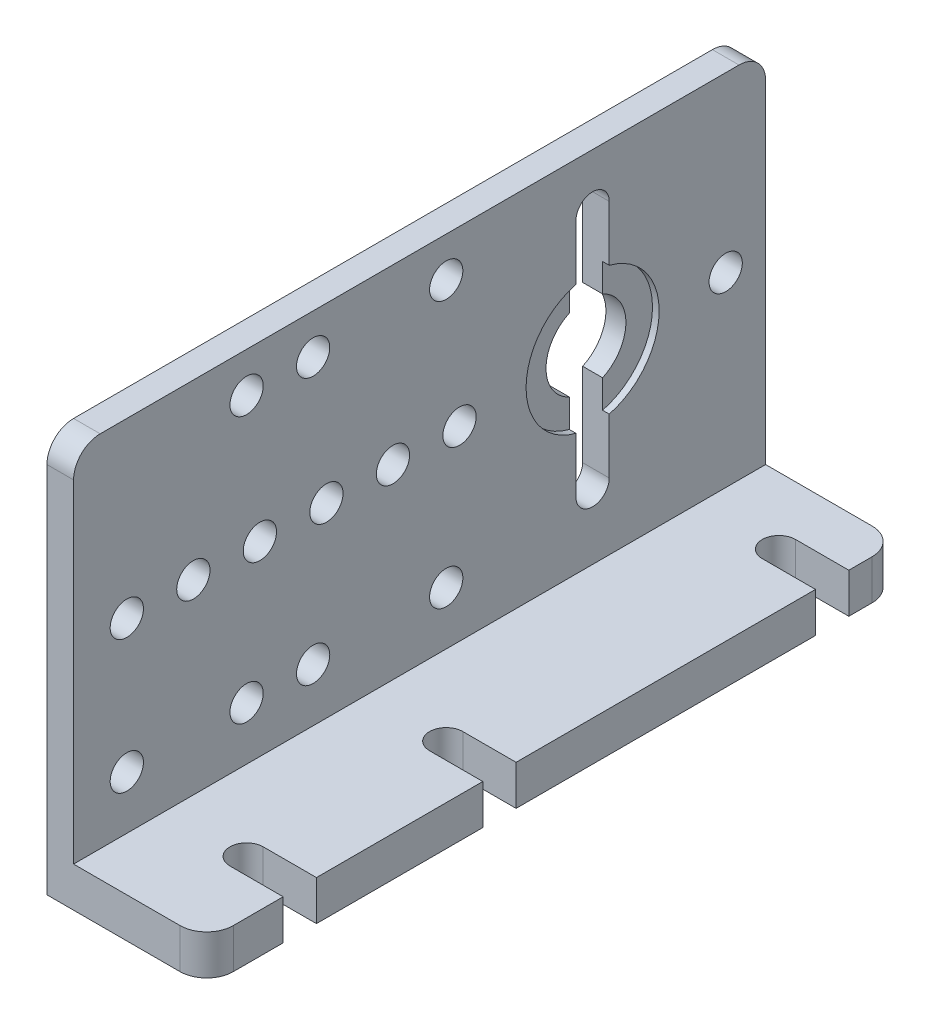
ISO-10303-21;
HEADER;
FILE_DESCRIPTION(('STEP AP214'),'2;1');
FILE_NAME('part.step','',(''),(''),'','','');
FILE_SCHEMA(('AUTOMOTIVE_DESIGN { 1 0 10303 214 1 1 1 1 }'));
ENDSEC;
DATA;
#1=APPLICATION_CONTEXT('core data for automotive mechanical design processes');
#2=APPLICATION_PROTOCOL_DEFINITION('international standard','automotive_design',2000,#1);
#3=PRODUCT_CONTEXT('',#1,'mechanical');
#4=PRODUCT('Part','Part','',(#3));
#5=PRODUCT_RELATED_PRODUCT_CATEGORY('part','',(#4));
#6=PRODUCT_DEFINITION_FORMATION('','',#4);
#7=PRODUCT_DEFINITION_CONTEXT('part definition',#1,'design');
#8=PRODUCT_DEFINITION('design','',#6,#7);
#9=PRODUCT_DEFINITION_SHAPE('','',#8);
#10=(LENGTH_UNIT() NAMED_UNIT(*) SI_UNIT(.MILLI.,.METRE.));
#11=(NAMED_UNIT(*) PLANE_ANGLE_UNIT() SI_UNIT($,.RADIAN.));
#12=(NAMED_UNIT(*) SI_UNIT($,.STERADIAN.) SOLID_ANGLE_UNIT());
#13=UNCERTAINTY_MEASURE_WITH_UNIT(LENGTH_MEASURE(1.E-05),#10,'distance_accuracy_value','');
#14=(GEOMETRIC_REPRESENTATION_CONTEXT(3) GLOBAL_UNCERTAINTY_ASSIGNED_CONTEXT((#13)) GLOBAL_UNIT_ASSIGNED_CONTEXT((#10,
#11,#12)) REPRESENTATION_CONTEXT('',''));
#15=CARTESIAN_POINT('',(0.,0.,0.));
#16=DIRECTION('',(0.,0.,1.));
#17=DIRECTION('',(1.,0.,0.));
#18=AXIS2_PLACEMENT_3D('',#15,#16,#17);
#19=CARTESIAN_POINT('',(10.,3.,52.));
#20=DIRECTION('',(-1.,0.,0.));
#21=DIRECTION('',(0.,0.,1.));
#22=AXIS2_PLACEMENT_3D('',#19,#20,#21);
#23=PLANE('',#22);
#24=DIRECTION('',(0.,0.,-1.));
#25=VECTOR('',#24,1.);
#26=CARTESIAN_POINT('',(10.,3.,52.));
#27=LINE('',#26,#25);
#28=CARTESIAN_POINT('',(10.,3.,28.75));
#29=VERTEX_POINT('',#28);
#30=CARTESIAN_POINT('',(10.,3.,6.25));
#31=VERTEX_POINT('',#30);
#32=EDGE_CURVE('E602',#29,#31,#27,.T.);
#33=ORIENTED_EDGE('',*,*,#32,.F.);
#34=DIRECTION('',(0.,1.,0.));
#35=VECTOR('',#34,1.);
#36=CARTESIAN_POINT('',(10.,0.,28.75));
#37=LINE('',#36,#35);
#38=CARTESIAN_POINT('',(10.,0.,28.75));
#39=VERTEX_POINT('',#38);
#40=EDGE_CURVE('E594',#39,#29,#37,.T.);
#41=ORIENTED_EDGE('',*,*,#40,.F.);
#42=DIRECTION('',(0.,0.,-1.));
#43=VECTOR('',#42,1.);
#44=CARTESIAN_POINT('',(10.,0.,52.));
#45=LINE('',#44,#43);
#46=CARTESIAN_POINT('',(10.,0.,6.25));
#47=VERTEX_POINT('',#46);
#48=EDGE_CURVE('E837',#39,#47,#45,.T.);
#49=ORIENTED_EDGE('',*,*,#48,.T.);
#50=DIRECTION('',(0.,1.,0.));
#51=VECTOR('',#50,1.);
#52=CARTESIAN_POINT('',(10.,0.,6.25));
#53=LINE('',#52,#51);
#54=EDGE_CURVE('E791',#47,#31,#53,.T.);
#55=ORIENTED_EDGE('',*,*,#54,.T.);
#56=EDGE_LOOP('',(#33,#41,#49,#55));
#57=FACE_BOUND('',#56,.T.);
#58=ADVANCED_FACE('F355',(#57),#23,.F.);
#59=CARTESIAN_POINT('',(10.,3.,3.75));
#60=VERTEX_POINT('',#59);
#61=CARTESIAN_POINT('',(10.,3.,2.00000000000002));
#62=VERTEX_POINT('',#61);
#63=EDGE_CURVE('E604',#60,#62,#27,.T.);
#64=ORIENTED_EDGE('',*,*,#63,.F.);
#65=DIRECTION('',(0.,1.,0.));
#66=VECTOR('',#65,1.);
#67=CARTESIAN_POINT('',(10.,0.,3.75));
#68=LINE('',#67,#66);
#69=CARTESIAN_POINT('',(10.,0.,3.75));
#70=VERTEX_POINT('',#69);
#71=EDGE_CURVE('E795',#70,#60,#68,.T.);
#72=ORIENTED_EDGE('',*,*,#71,.F.);
#73=CARTESIAN_POINT('',(10.,0.,2.00000000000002));
#74=VERTEX_POINT('',#73);
#75=EDGE_CURVE('E606',#70,#74,#45,.T.);
#76=ORIENTED_EDGE('',*,*,#75,.T.);
#77=DIRECTION('',(0.,1.,0.));
#78=VECTOR('',#77,1.);
#79=CARTESIAN_POINT('',(10.,3.,2.));
#80=LINE('',#79,#78);
#81=EDGE_CURVE('E852',#74,#62,#80,.T.);
#82=ORIENTED_EDGE('',*,*,#81,.T.);
#83=EDGE_LOOP('',(#64,#72,#76,#82));
#84=FACE_BOUND('',#83,.T.);
#85=ADVANCED_FACE('F850',(#84),#23,.F.);
#86=CARTESIAN_POINT('',(10.,0.,50.));
#87=VERTEX_POINT('',#86);
#88=CARTESIAN_POINT('',(10.,0.,46.25));
#89=VERTEX_POINT('',#88);
#90=EDGE_CURVE('E1026',#87,#89,#45,.T.);
#91=ORIENTED_EDGE('',*,*,#90,.T.);
#92=DIRECTION('',(0.,1.,0.));
#93=VECTOR('',#92,1.);
#94=CARTESIAN_POINT('',(10.,0.,46.25));
#95=LINE('',#94,#93);
#96=CARTESIAN_POINT('',(10.,3.,46.25));
#97=VERTEX_POINT('',#96);
#98=EDGE_CURVE('E771',#89,#97,#95,.T.);
#99=ORIENTED_EDGE('',*,*,#98,.T.);
#100=CARTESIAN_POINT('',(10.,3.,50.));
#101=VERTEX_POINT('',#100);
#102=EDGE_CURVE('E601',#101,#97,#27,.T.);
#103=ORIENTED_EDGE('',*,*,#102,.F.);
#104=DIRECTION('',(0.,1.,0.));
#105=VECTOR('',#104,1.);
#106=CARTESIAN_POINT('',(10.,3.,50.));
#107=LINE('',#106,#105);
#108=EDGE_CURVE('E857',#101,#87,#107,.F.);
#109=ORIENTED_EDGE('',*,*,#108,.T.);
#110=EDGE_LOOP('',(#91,#99,#103,#109));
#111=FACE_BOUND('',#110,.T.);
#112=ADVANCED_FACE('F1010',(#111),#23,.F.);
#113=CARTESIAN_POINT('',(10.,17.,13.));
#114=DIRECTION('',(-1.,0.,0.));
#115=DIRECTION('',(0.,0.,1.));
#116=AXIS2_PLACEMENT_3D('',#113,#114,#115);
#117=CYLINDRICAL_SURFACE('',#116,3.);
#118=CARTESIAN_POINT('',(-0.499999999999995,17.,13.));
#119=DIRECTION('',(1.,0.,0.));
#120=DIRECTION('',(0.,1.,0.));
#121=AXIS2_PLACEMENT_3D('',#118,#119,#120);
#122=CIRCLE('',#121,3.);
#123=CARTESIAN_POINT('',(-0.499999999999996,14.2728219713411,14.25));
#124=VERTEX_POINT('',#123);
#125=CARTESIAN_POINT('',(-0.499999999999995,19.7271780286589,14.25));
#126=VERTEX_POINT('',#125);
#127=EDGE_CURVE('E755',#124,#126,#122,.F.);
#128=ORIENTED_EDGE('',*,*,#127,.F.);
#129=DIRECTION('',(-1.,0.,0.));
#130=VECTOR('',#129,1.);
#131=CARTESIAN_POINT('',(10.,14.2728219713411,14.25));
#132=LINE('',#131,#130);
#133=CARTESIAN_POINT('',(-2.,14.2728219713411,14.25));
#134=VERTEX_POINT('',#133);
#135=EDGE_CURVE('E642',#124,#134,#132,.T.);
#136=ORIENTED_EDGE('',*,*,#135,.T.);
#137=CARTESIAN_POINT('',(-2.,17.,13.));
#138=DIRECTION('',(-1.,0.,0.));
#139=DIRECTION('',(0.,0.,1.));
#140=AXIS2_PLACEMENT_3D('',#137,#138,#139);
#141=CIRCLE('',#140,3.);
#142=CARTESIAN_POINT('',(-2.,19.7271780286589,14.25));
#143=VERTEX_POINT('',#142);
#144=EDGE_CURVE('E679',#134,#143,#141,.T.);
#145=ORIENTED_EDGE('',*,*,#144,.T.);
#146=DIRECTION('',(-1.,0.,0.));
#147=VECTOR('',#146,1.);
#148=CARTESIAN_POINT('',(10.,19.7271780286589,14.25));
#149=LINE('',#148,#147);
#150=EDGE_CURVE('E643',#126,#143,#149,.T.);
#151=ORIENTED_EDGE('',*,*,#150,.F.);
#152=EDGE_LOOP('',(#128,#136,#145,#151));
#153=FACE_BOUND('',#152,.T.);
#154=ADVANCED_FACE('F958',(#153),#117,.F.);
#155=CARTESIAN_POINT('',(10.,17.,13.));
#156=DIRECTION('',(-1.,0.,0.));
#157=DIRECTION('',(0.,0.,1.));
#158=AXIS2_PLACEMENT_3D('',#155,#156,#157);
#159=CYLINDRICAL_SURFACE('',#158,3.);
#160=CARTESIAN_POINT('',(-0.499999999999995,17.,13.));
#161=DIRECTION('',(1.,0.,0.));
#162=DIRECTION('',(0.,1.,0.));
#163=AXIS2_PLACEMENT_3D('',#160,#161,#162);
#164=CIRCLE('',#163,3.);
#165=CARTESIAN_POINT('',(-0.499999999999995,19.7271780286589,11.75));
#166=VERTEX_POINT('',#165);
#167=CARTESIAN_POINT('',(-0.499999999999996,14.2728219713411,11.75));
#168=VERTEX_POINT('',#167);
#169=EDGE_CURVE('E749',#166,#168,#164,.F.);
#170=ORIENTED_EDGE('',*,*,#169,.F.);
#171=DIRECTION('',(-1.,0.,0.));
#172=VECTOR('',#171,1.);
#173=CARTESIAN_POINT('',(10.,19.7271780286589,11.75));
#174=LINE('',#173,#172);
#175=CARTESIAN_POINT('',(-2.,19.7271780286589,11.75));
#176=VERTEX_POINT('',#175);
#177=EDGE_CURVE('E650',#166,#176,#174,.T.);
#178=ORIENTED_EDGE('',*,*,#177,.T.);
#179=CARTESIAN_POINT('',(-2.,17.,13.));
#180=DIRECTION('',(-1.,0.,0.));
#181=DIRECTION('',(0.,0.,1.));
#182=AXIS2_PLACEMENT_3D('',#179,#180,#181);
#183=CIRCLE('',#182,3.);
#184=CARTESIAN_POINT('',(-2.,14.2728219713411,11.75));
#185=VERTEX_POINT('',#184);
#186=EDGE_CURVE('E667',#176,#185,#183,.T.);
#187=ORIENTED_EDGE('',*,*,#186,.T.);
#188=DIRECTION('',(-1.,0.,0.));
#189=VECTOR('',#188,1.);
#190=CARTESIAN_POINT('',(10.,14.2728219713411,11.75));
#191=LINE('',#190,#189);
#192=EDGE_CURVE('E652',#168,#185,#191,.T.);
#193=ORIENTED_EDGE('',*,*,#192,.F.);
#194=EDGE_LOOP('',(#170,#178,#187,#193));
#195=FACE_BOUND('',#194,.T.);
#196=ADVANCED_FACE('F991',(#195),#159,.F.);
#197=CARTESIAN_POINT('',(-2.,30.,52.));
#198=DIRECTION('',(0.,-1.,0.));
#199=DIRECTION('',(0.,0.,-1.));
#200=AXIS2_PLACEMENT_3D('',#197,#198,#199);
#201=PLANE('',#200);
#202=DIRECTION('',(0.,0.,-1.));
#203=VECTOR('',#202,1.);
#204=CARTESIAN_POINT('',(0.,30.,52.));
#205=LINE('',#204,#203);
#206=CARTESIAN_POINT('',(0.,30.,50.));
#207=VERTEX_POINT('',#206);
#208=CARTESIAN_POINT('',(0.,30.,2.00000000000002));
#209=VERTEX_POINT('',#208);
#210=EDGE_CURVE('E614',#207,#209,#205,.T.);
#211=ORIENTED_EDGE('',*,*,#210,.T.);
#212=DIRECTION('',(-1.,0.,0.));
#213=VECTOR('',#212,1.);
#214=CARTESIAN_POINT('',(-2.,30.,2.));
#215=LINE('',#214,#213);
#216=CARTESIAN_POINT('',(-2.,30.,2.00000000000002));
#217=VERTEX_POINT('',#216);
#218=EDGE_CURVE('E882',#209,#217,#215,.T.);
#219=ORIENTED_EDGE('',*,*,#218,.T.);
#220=DIRECTION('',(0.,0.,-1.));
#221=VECTOR('',#220,1.);
#222=CARTESIAN_POINT('',(-2.,30.,52.));
#223=LINE('',#222,#221);
#224=CARTESIAN_POINT('',(-2.,30.,50.));
#225=VERTEX_POINT('',#224);
#226=EDGE_CURVE('E861',#225,#217,#223,.T.);
#227=ORIENTED_EDGE('',*,*,#226,.F.);
#228=DIRECTION('',(-1.,0.,0.));
#229=VECTOR('',#228,1.);
#230=CARTESIAN_POINT('',(-2.,30.,50.));
#231=LINE('',#230,#229);
#232=EDGE_CURVE('E880',#225,#207,#231,.F.);
#233=ORIENTED_EDGE('',*,*,#232,.T.);
#234=EDGE_LOOP('',(#211,#219,#227,#233));
#235=FACE_BOUND('',#234,.T.);
#236=ADVANCED_FACE('F357',(#235),#201,.F.);
#237=CARTESIAN_POINT('',(-2.,0.,52.));
#238=DIRECTION('',(1.,0.,0.));
#239=DIRECTION('',(0.,0.,-1.));
#240=AXIS2_PLACEMENT_3D('',#237,#238,#239);
#241=PLANE('',#240);
#242=CARTESIAN_POINT('',(-2.,7.,34.));
#243=DIRECTION('',(-1.,0.,0.));
#244=DIRECTION('',(0.,0.,-1.));
#245=AXIS2_PLACEMENT_3D('',#242,#243,#244);
#246=CIRCLE('',#245,1.25);
#247=CARTESIAN_POINT('',(-2.,7.,32.75));
#248=VERTEX_POINT('',#247);
#249=EDGE_CURVE('E735',#248,#248,#246,.T.);
#250=ORIENTED_EDGE('',*,*,#249,.F.);
#251=EDGE_LOOP('',(#250));
#252=FACE_BOUND('',#251,.T.);
#253=CARTESIAN_POINT('',(-2.,7.00000000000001,24.));
#254=DIRECTION('',(-1.,0.,0.));
#255=DIRECTION('',(0.,0.,-1.));
#256=AXIS2_PLACEMENT_3D('',#253,#254,#255);
#257=CIRCLE('',#256,1.25);
#258=CARTESIAN_POINT('',(-2.,7.00000000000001,22.75));
#259=VERTEX_POINT('',#258);
#260=EDGE_CURVE('E731',#259,#259,#257,.T.);
#261=ORIENTED_EDGE('',*,*,#260,.F.);
#262=EDGE_LOOP('',(#261));
#263=FACE_BOUND('',#262,.T.);
#264=CARTESIAN_POINT('',(-2.,7.,39.));
#265=DIRECTION('',(-1.,0.,0.));
#266=DIRECTION('',(0.,0.,-1.));
#267=AXIS2_PLACEMENT_3D('',#264,#265,#266);
#268=CIRCLE('',#267,1.25);
#269=CARTESIAN_POINT('',(-2.,7.,37.75));
#270=VERTEX_POINT('',#269);
#271=EDGE_CURVE('E727',#270,#270,#268,.T.);
#272=ORIENTED_EDGE('',*,*,#271,.F.);
#273=EDGE_LOOP('',(#272));
#274=FACE_BOUND('',#273,.T.);
#275=CARTESIAN_POINT('',(-2.,7.,48.));
#276=DIRECTION('',(-1.,0.,0.));
#277=DIRECTION('',(0.,0.,1.));
#278=AXIS2_PLACEMENT_3D('',#275,#276,#277);
#279=CIRCLE('',#278,1.25000000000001);
#280=CARTESIAN_POINT('',(-2.,7.,49.25));
#281=VERTEX_POINT('',#280);
#282=EDGE_CURVE('E723',#281,#281,#279,.T.);
#283=ORIENTED_EDGE('',*,*,#282,.F.);
#284=EDGE_LOOP('',(#283));
#285=FACE_BOUND('',#284,.T.);
#286=CARTESIAN_POINT('',(-2.,27.,39.));
#287=DIRECTION('',(-1.,0.,0.));
#288=DIRECTION('',(0.,0.,1.));
#289=AXIS2_PLACEMENT_3D('',#286,#287,#288);
#290=CIRCLE('',#289,1.25);
#291=CARTESIAN_POINT('',(-2.,27.,40.25));
#292=VERTEX_POINT('',#291);
#293=EDGE_CURVE('E719',#292,#292,#290,.T.);
#294=ORIENTED_EDGE('',*,*,#293,.F.);
#295=EDGE_LOOP('',(#294));
#296=FACE_BOUND('',#295,.T.);
#297=CARTESIAN_POINT('',(-2.,27.,34.));
#298=DIRECTION('',(-1.,0.,0.));
#299=DIRECTION('',(0.,0.,1.));
#300=AXIS2_PLACEMENT_3D('',#297,#298,#299);
#301=CIRCLE('',#300,1.25);
#302=CARTESIAN_POINT('',(-2.,27.,35.25));
#303=VERTEX_POINT('',#302);
#304=EDGE_CURVE('E715',#303,#303,#301,.T.);
#305=ORIENTED_EDGE('',*,*,#304,.F.);
#306=EDGE_LOOP('',(#305));
#307=FACE_BOUND('',#306,.T.);
#308=CARTESIAN_POINT('',(-2.,27.,24.));
#309=DIRECTION('',(-1.,0.,0.));
#310=DIRECTION('',(0.,0.,1.));
#311=AXIS2_PLACEMENT_3D('',#308,#309,#310);
#312=CIRCLE('',#311,1.25);
#313=CARTESIAN_POINT('',(-2.,27.,25.25));
#314=VERTEX_POINT('',#313);
#315=EDGE_CURVE('E711',#314,#314,#312,.T.);
#316=ORIENTED_EDGE('',*,*,#315,.F.);
#317=EDGE_LOOP('',(#316));
#318=FACE_BOUND('',#317,.T.);
#319=CARTESIAN_POINT('',(-2.,17.,48.));
#320=DIRECTION('',(-1.,0.,0.));
#321=DIRECTION('',(0.,0.,-1.));
#322=AXIS2_PLACEMENT_3D('',#319,#320,#321);
#323=CIRCLE('',#322,1.25);
#324=CARTESIAN_POINT('',(-2.,17.,46.75));
#325=VERTEX_POINT('',#324);
#326=EDGE_CURVE('E707',#325,#325,#323,.T.);
#327=ORIENTED_EDGE('',*,*,#326,.F.);
#328=EDGE_LOOP('',(#327));
#329=FACE_BOUND('',#328,.T.);
#330=CARTESIAN_POINT('',(-2.,17.,43.));
#331=DIRECTION('',(-1.,0.,0.));
#332=DIRECTION('',(0.,0.,-1.));
#333=AXIS2_PLACEMENT_3D('',#330,#331,#332);
#334=CIRCLE('',#333,1.25);
#335=CARTESIAN_POINT('',(-2.,17.,41.75));
#336=VERTEX_POINT('',#335);
#337=EDGE_CURVE('E703',#336,#336,#334,.T.);
#338=ORIENTED_EDGE('',*,*,#337,.F.);
#339=EDGE_LOOP('',(#338));
#340=FACE_BOUND('',#339,.T.);
#341=CARTESIAN_POINT('',(-2.,17.,38.));
#342=DIRECTION('',(-1.,0.,0.));
#343=DIRECTION('',(0.,0.,-1.));
#344=AXIS2_PLACEMENT_3D('',#341,#342,#343);
#345=CIRCLE('',#344,1.25);
#346=CARTESIAN_POINT('',(-2.,17.,36.75));
#347=VERTEX_POINT('',#346);
#348=EDGE_CURVE('E699',#347,#347,#345,.T.);
#349=ORIENTED_EDGE('',*,*,#348,.F.);
#350=EDGE_LOOP('',(#349));
#351=FACE_BOUND('',#350,.T.);
#352=CARTESIAN_POINT('',(-2.,17.,33.));
#353=DIRECTION('',(-1.,0.,0.));
#354=DIRECTION('',(0.,0.,-1.));
#355=AXIS2_PLACEMENT_3D('',#352,#353,#354);
#356=CIRCLE('',#355,1.25);
#357=CARTESIAN_POINT('',(-2.,17.,31.75));
#358=VERTEX_POINT('',#357);
#359=EDGE_CURVE('E695',#358,#358,#356,.T.);
#360=ORIENTED_EDGE('',*,*,#359,.F.);
#361=EDGE_LOOP('',(#360));
#362=FACE_BOUND('',#361,.T.);
#363=CARTESIAN_POINT('',(-2.,17.,28.));
#364=DIRECTION('',(-1.,0.,0.));
#365=DIRECTION('',(0.,0.,-1.));
#366=AXIS2_PLACEMENT_3D('',#363,#364,#365);
#367=CIRCLE('',#366,1.25);
#368=CARTESIAN_POINT('',(-2.,17.,26.75));
#369=VERTEX_POINT('',#368);
#370=EDGE_CURVE('E691',#369,#369,#367,.T.);
#371=ORIENTED_EDGE('',*,*,#370,.F.);
#372=EDGE_LOOP('',(#371));
#373=FACE_BOUND('',#372,.T.);
#374=CARTESIAN_POINT('',(-2.,17.,23.));
#375=DIRECTION('',(-1.,0.,0.));
#376=DIRECTION('',(0.,0.,-1.));
#377=AXIS2_PLACEMENT_3D('',#374,#375,#376);
#378=CIRCLE('',#377,1.25);
#379=CARTESIAN_POINT('',(-2.,17.,21.75));
#380=VERTEX_POINT('',#379);
#381=EDGE_CURVE('E687',#380,#380,#378,.T.);
#382=ORIENTED_EDGE('',*,*,#381,.F.);
#383=EDGE_LOOP('',(#382));
#384=FACE_BOUND('',#383,.T.);
#385=CARTESIAN_POINT('',(-2.,17.,3.));
#386=DIRECTION('',(-1.,0.,0.));
#387=DIRECTION('',(0.,0.,1.));
#388=AXIS2_PLACEMENT_3D('',#385,#386,#387);
#389=CIRCLE('',#388,1.25);
#390=CARTESIAN_POINT('',(-2.,17.,4.25));
#391=VERTEX_POINT('',#390);
#392=EDGE_CURVE('E683',#391,#391,#389,.T.);
#393=ORIENTED_EDGE('',*,*,#392,.F.);
#394=EDGE_LOOP('',(#393));
#395=FACE_BOUND('',#394,.T.);
#396=DIRECTION('',(0.,1.,0.));
#397=VECTOR('',#396,1.);
#398=CARTESIAN_POINT('',(-2.,26.,14.25));
#399=LINE('',#398,#397);
#400=CARTESIAN_POINT('',(-2.,26.,14.25));
#401=VERTEX_POINT('',#400);
#402=EDGE_CURVE('E676',#143,#401,#399,.T.);
#403=ORIENTED_EDGE('',*,*,#402,.F.);
#404=ORIENTED_EDGE('',*,*,#144,.F.);
#405=DIRECTION('',(0.,1.,0.));
#406=VECTOR('',#405,1.);
#407=CARTESIAN_POINT('',(-2.,14.2728219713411,14.25));
#408=LINE('',#407,#406);
#409=CARTESIAN_POINT('',(-2.,8.,14.25));
#410=VERTEX_POINT('',#409);
#411=EDGE_CURVE('E646',#410,#134,#408,.T.);
#412=ORIENTED_EDGE('',*,*,#411,.F.);
#413=CARTESIAN_POINT('',(-2.,8.,13.));
#414=DIRECTION('',(-1.,0.,0.));
#415=DIRECTION('',(0.,0.,1.));
#416=AXIS2_PLACEMENT_3D('',#413,#414,#415);
#417=CIRCLE('',#416,1.25);
#418=CARTESIAN_POINT('',(-2.,8.,11.75));
#419=VERTEX_POINT('',#418);
#420=EDGE_CURVE('E661',#419,#410,#417,.T.);
#421=ORIENTED_EDGE('',*,*,#420,.F.);
#422=DIRECTION('',(0.,-1.,0.));
#423=VECTOR('',#422,1.);
#424=CARTESIAN_POINT('',(-2.,14.2728219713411,11.75));
#425=LINE('',#424,#423);
#426=EDGE_CURVE('E664',#185,#419,#425,.T.);
#427=ORIENTED_EDGE('',*,*,#426,.F.);
#428=ORIENTED_EDGE('',*,*,#186,.F.);
#429=DIRECTION('',(0.,-1.,0.));
#430=VECTOR('',#429,1.);
#431=CARTESIAN_POINT('',(-2.,26.,11.75));
#432=LINE('',#431,#430);
#433=CARTESIAN_POINT('',(-2.,26.,11.75));
#434=VERTEX_POINT('',#433);
#435=EDGE_CURVE('E670',#434,#176,#432,.T.);
#436=ORIENTED_EDGE('',*,*,#435,.F.);
#437=CARTESIAN_POINT('',(-2.,26.,13.));
#438=DIRECTION('',(-1.,0.,0.));
#439=DIRECTION('',(0.,0.,1.));
#440=AXIS2_PLACEMENT_3D('',#437,#438,#439);
#441=CIRCLE('',#440,1.25);
#442=EDGE_CURVE('E673',#401,#434,#441,.T.);
#443=ORIENTED_EDGE('',*,*,#442,.F.);
#444=EDGE_LOOP('',(#403,#404,#412,#421,#427,#428,#436,#443));
#445=FACE_BOUND('',#444,.T.);
#446=ORIENTED_EDGE('',*,*,#226,.T.);
#447=CARTESIAN_POINT('',(-2.,28.,2.));
#448=DIRECTION('',(1.,0.,0.));
#449=DIRECTION('',(0.,0.,-1.));
#450=AXIS2_PLACEMENT_3D('',#447,#448,#449);
#451=CIRCLE('',#450,2.);
#452=CARTESIAN_POINT('',(-2.,28.,0.));
#453=VERTEX_POINT('',#452);
#454=EDGE_CURVE('E887',#217,#453,#451,.F.);
#455=ORIENTED_EDGE('',*,*,#454,.T.);
#456=DIRECTION('',(0.,-1.,0.));
#457=VECTOR('',#456,1.);
#458=CARTESIAN_POINT('',(-2.,0.,0.));
#459=LINE('',#458,#457);
#460=CARTESIAN_POINT('',(-2.,0.,0.));
#461=VERTEX_POINT('',#460);
#462=EDGE_CURVE('E640',#453,#461,#459,.T.);
#463=ORIENTED_EDGE('',*,*,#462,.T.);
#464=DIRECTION('',(0.,0.,-1.));
#465=VECTOR('',#464,1.);
#466=CARTESIAN_POINT('',(-2.,0.,52.));
#467=LINE('',#466,#465);
#468=CARTESIAN_POINT('',(-2.,0.,52.));
#469=VERTEX_POINT('',#468);
#470=EDGE_CURVE('E1030',#469,#461,#467,.T.);
#471=ORIENTED_EDGE('',*,*,#470,.F.);
#472=DIRECTION('',(0.,-1.,0.));
#473=VECTOR('',#472,1.);
#474=CARTESIAN_POINT('',(-2.,0.,52.));
#475=LINE('',#474,#473);
#476=CARTESIAN_POINT('',(-2.,28.,52.));
#477=VERTEX_POINT('',#476);
#478=EDGE_CURVE('E631',#477,#469,#475,.T.);
#479=ORIENTED_EDGE('',*,*,#478,.F.);
#480=CARTESIAN_POINT('',(-2.,28.,50.));
#481=DIRECTION('',(1.,0.,0.));
#482=DIRECTION('',(0.,0.,-1.));
#483=AXIS2_PLACEMENT_3D('',#480,#481,#482);
#484=CIRCLE('',#483,2.);
#485=EDGE_CURVE('E885',#477,#225,#484,.F.);
#486=ORIENTED_EDGE('',*,*,#485,.T.);
#487=EDGE_LOOP('',(#446,#455,#463,#471,#479,#486));
#488=FACE_BOUND('',#487,.T.);
#489=ADVANCED_FACE('F964',(#252,#263,#274,#285,#296,#307,#318,#329,#340,#351,#362,#373,#384,
#395,#445,#488),#241,.F.);
#490=CARTESIAN_POINT('',(-2.,0.,52.));
#491=DIRECTION('',(0.,1.,0.));
#492=DIRECTION('',(-1.,0.,0.));
#493=AXIS2_PLACEMENT_3D('',#490,#491,#492);
#494=PLANE('',#493);
#495=ORIENTED_EDGE('',*,*,#48,.F.);
#496=DIRECTION('',(-1.,0.,0.));
#497=VECTOR('',#496,1.);
#498=CARTESIAN_POINT('',(10.,0.,28.75));
#499=LINE('',#498,#497);
#500=CARTESIAN_POINT('',(6.,0.,28.75));
#501=VERTEX_POINT('',#500);
#502=EDGE_CURVE('E814',#39,#501,#499,.T.);
#503=ORIENTED_EDGE('',*,*,#502,.T.);
#504=CARTESIAN_POINT('',(6.,0.,30.));
#505=DIRECTION('',(0.,1.,0.));
#506=DIRECTION('',(-1.,0.,0.));
#507=AXIS2_PLACEMENT_3D('',#504,#505,#506);
#508=CIRCLE('',#507,1.25);
#509=CARTESIAN_POINT('',(6.,0.,31.25));
#510=VERTEX_POINT('',#509);
#511=EDGE_CURVE('E822',#501,#510,#508,.T.);
#512=ORIENTED_EDGE('',*,*,#511,.T.);
#513=DIRECTION('',(1.,0.,0.));
#514=VECTOR('',#513,1.);
#515=CARTESIAN_POINT('',(10.,0.,31.25));
#516=LINE('',#515,#514);
#517=CARTESIAN_POINT('',(10.,0.,31.25));
#518=VERTEX_POINT('',#517);
#519=EDGE_CURVE('E820',#510,#518,#516,.T.);
#520=ORIENTED_EDGE('',*,*,#519,.T.);
#521=CARTESIAN_POINT('',(10.,0.,43.75));
#522=VERTEX_POINT('',#521);
#523=EDGE_CURVE('E593',#522,#518,#45,.T.);
#524=ORIENTED_EDGE('',*,*,#523,.F.);
#525=DIRECTION('',(-1.,0.,0.));
#526=VECTOR('',#525,1.);
#527=CARTESIAN_POINT('',(10.,0.,43.75));
#528=LINE('',#527,#526);
#529=CARTESIAN_POINT('',(6.,0.,43.75));
#530=VERTEX_POINT('',#529);
#531=EDGE_CURVE('E779',#522,#530,#528,.T.);
#532=ORIENTED_EDGE('',*,*,#531,.T.);
#533=CARTESIAN_POINT('',(6.,0.,45.));
#534=DIRECTION('',(0.,1.,0.));
#535=DIRECTION('',(-1.,0.,0.));
#536=AXIS2_PLACEMENT_3D('',#533,#534,#535);
#537=CIRCLE('',#536,1.25);
#538=CARTESIAN_POINT('',(6.,0.,46.25));
#539=VERTEX_POINT('',#538);
#540=EDGE_CURVE('E776',#530,#539,#537,.T.);
#541=ORIENTED_EDGE('',*,*,#540,.T.);
#542=DIRECTION('',(1.,0.,0.));
#543=VECTOR('',#542,1.);
#544=CARTESIAN_POINT('',(10.,0.,46.25));
#545=LINE('',#544,#543);
#546=EDGE_CURVE('E767',#539,#89,#545,.T.);
#547=ORIENTED_EDGE('',*,*,#546,.T.);
#548=ORIENTED_EDGE('',*,*,#90,.F.);
#549=CARTESIAN_POINT('',(8.,0.,50.));
#550=DIRECTION('',(0.,1.,0.));
#551=DIRECTION('',(-1.,0.,0.));
#552=AXIS2_PLACEMENT_3D('',#549,#550,#551);
#553=CIRCLE('',#552,2.);
#554=CARTESIAN_POINT('',(8.,0.,52.));
#555=VERTEX_POINT('',#554);
#556=EDGE_CURVE('E870',#87,#555,#553,.F.);
#557=ORIENTED_EDGE('',*,*,#556,.T.);
#558=DIRECTION('',(1.,0.,0.));
#559=VECTOR('',#558,1.);
#560=CARTESIAN_POINT('',(-2.,0.,52.));
#561=LINE('',#560,#559);
#562=EDGE_CURVE('E628',#469,#555,#561,.T.);
#563=ORIENTED_EDGE('',*,*,#562,.F.);
#564=ORIENTED_EDGE('',*,*,#470,.T.);
#565=DIRECTION('',(1.,0.,0.));
#566=VECTOR('',#565,1.);
#567=CARTESIAN_POINT('',(-2.,0.,0.));
#568=LINE('',#567,#566);
#569=CARTESIAN_POINT('',(8.,0.,0.));
#570=VERTEX_POINT('',#569);
#571=EDGE_CURVE('E637',#461,#570,#568,.T.);
#572=ORIENTED_EDGE('',*,*,#571,.T.);
#573=CARTESIAN_POINT('',(8.,0.,2.));
#574=DIRECTION('',(0.,1.,0.));
#575=DIRECTION('',(-1.,0.,0.));
#576=AXIS2_PLACEMENT_3D('',#573,#574,#575);
#577=CIRCLE('',#576,2.);
#578=EDGE_CURVE('E872',#570,#74,#577,.F.);
#579=ORIENTED_EDGE('',*,*,#578,.T.);
#580=ORIENTED_EDGE('',*,*,#75,.F.);
#581=DIRECTION('',(-1.,0.,0.));
#582=VECTOR('',#581,1.);
#583=CARTESIAN_POINT('',(10.,0.,3.75));
#584=LINE('',#583,#582);
#585=CARTESIAN_POINT('',(6.,0.,3.75));
#586=VERTEX_POINT('',#585);
#587=EDGE_CURVE('E792',#70,#586,#584,.T.);
#588=ORIENTED_EDGE('',*,*,#587,.T.);
#589=CARTESIAN_POINT('',(6.,0.,5.));
#590=DIRECTION('',(0.,1.,0.));
#591=DIRECTION('',(-1.,0.,0.));
#592=AXIS2_PLACEMENT_3D('',#589,#590,#591);
#593=CIRCLE('',#592,1.25);
#594=CARTESIAN_POINT('',(6.,0.,6.25));
#595=VERTEX_POINT('',#594);
#596=EDGE_CURVE('E803',#586,#595,#593,.T.);
#597=ORIENTED_EDGE('',*,*,#596,.T.);
#598=DIRECTION('',(1.,0.,0.));
#599=VECTOR('',#598,1.);
#600=CARTESIAN_POINT('',(10.,0.,6.25));
#601=LINE('',#600,#599);
#602=EDGE_CURVE('E800',#595,#47,#601,.T.);
#603=ORIENTED_EDGE('',*,*,#602,.T.);
#604=EDGE_LOOP('',(#495,#503,#512,#520,#524,#532,#541,#547,#548,#557,#563,#564,#572,#579,#580,
#588,#597,#603));
#605=FACE_BOUND('',#604,.T.);
#606=ADVANCED_FACE('F842',(#605),#494,.F.);
#607=ORIENTED_EDGE('',*,*,#523,.T.);
#608=DIRECTION('',(0.,1.,0.));
#609=VECTOR('',#608,1.);
#610=CARTESIAN_POINT('',(10.,0.,31.25));
#611=LINE('',#610,#609);
#612=CARTESIAN_POINT('',(10.,3.,31.25));
#613=VERTEX_POINT('',#612);
#614=EDGE_CURVE('E579',#518,#613,#611,.T.);
#615=ORIENTED_EDGE('',*,*,#614,.T.);
#616=CARTESIAN_POINT('',(10.,3.,43.75));
#617=VERTEX_POINT('',#616);
#618=EDGE_CURVE('E591',#617,#613,#27,.T.);
#619=ORIENTED_EDGE('',*,*,#618,.F.);
#620=DIRECTION('',(0.,1.,0.));
#621=VECTOR('',#620,1.);
#622=CARTESIAN_POINT('',(10.,0.,43.75));
#623=LINE('',#622,#621);
#624=EDGE_CURVE('E764',#522,#617,#623,.T.);
#625=ORIENTED_EDGE('',*,*,#624,.F.);
#626=EDGE_LOOP('',(#607,#615,#619,#625));
#627=FACE_BOUND('',#626,.T.);
#628=ADVANCED_FACE('F589',(#627),#23,.F.);
#629=CARTESIAN_POINT('',(0.,3.,52.));
#630=DIRECTION('',(0.,-1.,0.));
#631=DIRECTION('',(1.,0.,0.));
#632=AXIS2_PLACEMENT_3D('',#629,#630,#631);
#633=PLANE('',#632);
#634=CARTESIAN_POINT('',(6.,3.,30.));
#635=DIRECTION('',(0.,1.,0.));
#636=DIRECTION('',(-1.,0.,0.));
#637=AXIS2_PLACEMENT_3D('',#634,#635,#636);
#638=CIRCLE('',#637,1.25);
#639=CARTESIAN_POINT('',(6.,3.,28.75));
#640=VERTEX_POINT('',#639);
#641=CARTESIAN_POINT('',(6.,3.,31.25));
#642=VERTEX_POINT('',#641);
#643=EDGE_CURVE('E370',#640,#642,#638,.T.);
#644=ORIENTED_EDGE('',*,*,#643,.F.);
#645=DIRECTION('',(-1.,0.,0.));
#646=VECTOR('',#645,1.);
#647=CARTESIAN_POINT('',(10.,3.,28.75));
#648=LINE('',#647,#646);
#649=EDGE_CURVE('E584',#29,#640,#648,.T.);
#650=ORIENTED_EDGE('',*,*,#649,.F.);
#651=ORIENTED_EDGE('',*,*,#32,.T.);
#652=DIRECTION('',(1.,0.,0.));
#653=VECTOR('',#652,1.);
#654=CARTESIAN_POINT('',(10.,3.,6.25));
#655=LINE('',#654,#653);
#656=CARTESIAN_POINT('',(6.,3.,6.25));
#657=VERTEX_POINT('',#656);
#658=EDGE_CURVE('E809',#657,#31,#655,.T.);
#659=ORIENTED_EDGE('',*,*,#658,.F.);
#660=CARTESIAN_POINT('',(6.,3.,5.));
#661=DIRECTION('',(0.,1.,0.));
#662=DIRECTION('',(-1.,0.,0.));
#663=AXIS2_PLACEMENT_3D('',#660,#661,#662);
#664=CIRCLE('',#663,1.25);
#665=CARTESIAN_POINT('',(6.,3.,3.75));
#666=VERTEX_POINT('',#665);
#667=EDGE_CURVE('E378',#666,#657,#664,.T.);
#668=ORIENTED_EDGE('',*,*,#667,.F.);
#669=DIRECTION('',(-1.,0.,0.));
#670=VECTOR('',#669,1.);
#671=CARTESIAN_POINT('',(10.,3.,3.75));
#672=LINE('',#671,#670);
#673=EDGE_CURVE('E806',#60,#666,#672,.T.);
#674=ORIENTED_EDGE('',*,*,#673,.F.);
#675=ORIENTED_EDGE('',*,*,#63,.T.);
#676=CARTESIAN_POINT('',(8.,3.,2.));
#677=DIRECTION('',(0.,-1.,0.));
#678=DIRECTION('',(1.,0.,0.));
#679=AXIS2_PLACEMENT_3D('',#676,#677,#678);
#680=CIRCLE('',#679,2.);
#681=CARTESIAN_POINT('',(8.,3.,0.));
#682=VERTEX_POINT('',#681);
#683=EDGE_CURVE('E859',#62,#682,#680,.F.);
#684=ORIENTED_EDGE('',*,*,#683,.T.);
#685=DIRECTION('',(-1.,0.,0.));
#686=VECTOR('',#685,1.);
#687=CARTESIAN_POINT('',(0.,3.,0.));
#688=LINE('',#687,#686);
#689=CARTESIAN_POINT('',(0.,3.,0.));
#690=VERTEX_POINT('',#689);
#691=EDGE_CURVE('E635',#682,#690,#688,.T.);
#692=ORIENTED_EDGE('',*,*,#691,.T.);
#693=DIRECTION('',(0.,0.,-1.));
#694=VECTOR('',#693,1.);
#695=CARTESIAN_POINT('',(0.,3.,52.));
#696=LINE('',#695,#694);
#697=CARTESIAN_POINT('',(0.,3.,52.));
#698=VERTEX_POINT('',#697);
#699=EDGE_CURVE('E609',#698,#690,#696,.T.);
#700=ORIENTED_EDGE('',*,*,#699,.F.);
#701=DIRECTION('',(-1.,0.,0.));
#702=VECTOR('',#701,1.);
#703=CARTESIAN_POINT('',(0.,3.,52.));
#704=LINE('',#703,#702);
#705=CARTESIAN_POINT('',(8.,3.,52.));
#706=VERTEX_POINT('',#705);
#707=EDGE_CURVE('E626',#706,#698,#704,.T.);
#708=ORIENTED_EDGE('',*,*,#707,.F.);
#709=CARTESIAN_POINT('',(8.,3.,50.));
#710=DIRECTION('',(0.,-1.,0.));
#711=DIRECTION('',(1.,0.,0.));
#712=AXIS2_PLACEMENT_3D('',#709,#710,#711);
#713=CIRCLE('',#712,2.);
#714=EDGE_CURVE('E856',#706,#101,#713,.F.);
#715=ORIENTED_EDGE('',*,*,#714,.T.);
#716=ORIENTED_EDGE('',*,*,#102,.T.);
#717=DIRECTION('',(1.,0.,0.));
#718=VECTOR('',#717,1.);
#719=CARTESIAN_POINT('',(10.,3.,46.25));
#720=LINE('',#719,#718);
#721=CARTESIAN_POINT('',(6.,3.,46.25));
#722=VERTEX_POINT('',#721);
#723=EDGE_CURVE('E782',#722,#97,#720,.T.);
#724=ORIENTED_EDGE('',*,*,#723,.F.);
#725=CARTESIAN_POINT('',(6.,3.,45.));
#726=DIRECTION('',(0.,1.,0.));
#727=DIRECTION('',(-1.,0.,0.));
#728=AXIS2_PLACEMENT_3D('',#725,#726,#727);
#729=CIRCLE('',#728,1.25);
#730=CARTESIAN_POINT('',(6.,3.,43.75));
#731=VERTEX_POINT('',#730);
#732=EDGE_CURVE('E784',#731,#722,#729,.T.);
#733=ORIENTED_EDGE('',*,*,#732,.F.);
#734=DIRECTION('',(-1.,0.,0.));
#735=VECTOR('',#734,1.);
#736=CARTESIAN_POINT('',(10.,3.,43.75));
#737=LINE('',#736,#735);
#738=EDGE_CURVE('E600',#617,#731,#737,.T.);
#739=ORIENTED_EDGE('',*,*,#738,.F.);
#740=ORIENTED_EDGE('',*,*,#618,.T.);
#741=DIRECTION('',(1.,0.,0.));
#742=VECTOR('',#741,1.);
#743=CARTESIAN_POINT('',(10.,3.,31.25));
#744=LINE('',#743,#742);
#745=EDGE_CURVE('E575',#642,#613,#744,.T.);
#746=ORIENTED_EDGE('',*,*,#745,.F.);
#747=EDGE_LOOP('',(#644,#650,#651,#659,#668,#674,#675,#684,#692,#700,#708,#715,#716,#724,#733,
#739,#740,#746));
#748=FACE_BOUND('',#747,.T.);
#749=ADVANCED_FACE('F597',(#748),#633,.F.);
#750=CARTESIAN_POINT('',(0.,30.,52.));
#751=DIRECTION('',(-1.,0.,0.));
#752=DIRECTION('',(0.,-1.,0.));
#753=AXIS2_PLACEMENT_3D('',#750,#751,#752);
#754=PLANE('',#753);
#755=CARTESIAN_POINT('',(0.,7.,34.));
#756=DIRECTION('',(-1.,0.,0.));
#757=DIRECTION('',(0.,-1.,0.));
#758=AXIS2_PLACEMENT_3D('',#755,#756,#757);
#759=CIRCLE('',#758,1.25);
#760=CARTESIAN_POINT('',(0.,5.75000000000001,34.));
#761=VERTEX_POINT('',#760);
#762=EDGE_CURVE('E734',#761,#761,#759,.T.);
#763=ORIENTED_EDGE('',*,*,#762,.T.);
#764=EDGE_LOOP('',(#763));
#765=FACE_BOUND('',#764,.T.);
#766=CARTESIAN_POINT('',(0.,7.00000000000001,24.));
#767=DIRECTION('',(-1.,0.,0.));
#768=DIRECTION('',(0.,-1.,0.));
#769=AXIS2_PLACEMENT_3D('',#766,#767,#768);
#770=CIRCLE('',#769,1.25);
#771=CARTESIAN_POINT('',(0.,5.75000000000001,24.));
#772=VERTEX_POINT('',#771);
#773=EDGE_CURVE('E730',#772,#772,#770,.T.);
#774=ORIENTED_EDGE('',*,*,#773,.T.);
#775=EDGE_LOOP('',(#774));
#776=FACE_BOUND('',#775,.T.);
#777=CARTESIAN_POINT('',(0.,7.,39.));
#778=DIRECTION('',(-1.,0.,0.));
#779=DIRECTION('',(0.,-1.,0.));
#780=AXIS2_PLACEMENT_3D('',#777,#778,#779);
#781=CIRCLE('',#780,1.25);
#782=CARTESIAN_POINT('',(0.,5.75,39.));
#783=VERTEX_POINT('',#782);
#784=EDGE_CURVE('E726',#783,#783,#781,.T.);
#785=ORIENTED_EDGE('',*,*,#784,.T.);
#786=EDGE_LOOP('',(#785));
#787=FACE_BOUND('',#786,.T.);
#788=CARTESIAN_POINT('',(0.,7.,48.));
#789=DIRECTION('',(-1.,0.,0.));
#790=DIRECTION('',(0.,-1.,0.));
#791=AXIS2_PLACEMENT_3D('',#788,#789,#790);
#792=CIRCLE('',#791,1.25000000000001);
#793=CARTESIAN_POINT('',(0.,5.75,48.));
#794=VERTEX_POINT('',#793);
#795=EDGE_CURVE('E722',#794,#794,#792,.T.);
#796=ORIENTED_EDGE('',*,*,#795,.T.);
#797=EDGE_LOOP('',(#796));
#798=FACE_BOUND('',#797,.T.);
#799=CARTESIAN_POINT('',(0.,27.,39.));
#800=DIRECTION('',(-1.,0.,0.));
#801=DIRECTION('',(0.,-1.,0.));
#802=AXIS2_PLACEMENT_3D('',#799,#800,#801);
#803=CIRCLE('',#802,1.25);
#804=CARTESIAN_POINT('',(0.,25.75,39.));
#805=VERTEX_POINT('',#804);
#806=EDGE_CURVE('E718',#805,#805,#803,.T.);
#807=ORIENTED_EDGE('',*,*,#806,.T.);
#808=EDGE_LOOP('',(#807));
#809=FACE_BOUND('',#808,.T.);
#810=CARTESIAN_POINT('',(0.,27.,34.));
#811=DIRECTION('',(-1.,0.,0.));
#812=DIRECTION('',(0.,-1.,0.));
#813=AXIS2_PLACEMENT_3D('',#810,#811,#812);
#814=CIRCLE('',#813,1.25);
#815=CARTESIAN_POINT('',(0.,25.75,34.));
#816=VERTEX_POINT('',#815);
#817=EDGE_CURVE('E714',#816,#816,#814,.T.);
#818=ORIENTED_EDGE('',*,*,#817,.T.);
#819=EDGE_LOOP('',(#818));
#820=FACE_BOUND('',#819,.T.);
#821=CARTESIAN_POINT('',(0.,27.,24.));
#822=DIRECTION('',(-1.,0.,0.));
#823=DIRECTION('',(0.,-1.,0.));
#824=AXIS2_PLACEMENT_3D('',#821,#822,#823);
#825=CIRCLE('',#824,1.25);
#826=CARTESIAN_POINT('',(0.,25.75,24.));
#827=VERTEX_POINT('',#826);
#828=EDGE_CURVE('E710',#827,#827,#825,.T.);
#829=ORIENTED_EDGE('',*,*,#828,.T.);
#830=EDGE_LOOP('',(#829));
#831=FACE_BOUND('',#830,.T.);
#832=CARTESIAN_POINT('',(0.,17.,48.));
#833=DIRECTION('',(-1.,0.,0.));
#834=DIRECTION('',(0.,-1.,0.));
#835=AXIS2_PLACEMENT_3D('',#832,#833,#834);
#836=CIRCLE('',#835,1.25);
#837=CARTESIAN_POINT('',(0.,15.75,48.));
#838=VERTEX_POINT('',#837);
#839=EDGE_CURVE('E706',#838,#838,#836,.T.);
#840=ORIENTED_EDGE('',*,*,#839,.T.);
#841=EDGE_LOOP('',(#840));
#842=FACE_BOUND('',#841,.T.);
#843=CARTESIAN_POINT('',(0.,17.,43.));
#844=DIRECTION('',(-1.,0.,0.));
#845=DIRECTION('',(0.,-1.,0.));
#846=AXIS2_PLACEMENT_3D('',#843,#844,#845);
#847=CIRCLE('',#846,1.25);
#848=CARTESIAN_POINT('',(0.,15.75,43.));
#849=VERTEX_POINT('',#848);
#850=EDGE_CURVE('E702',#849,#849,#847,.T.);
#851=ORIENTED_EDGE('',*,*,#850,.T.);
#852=EDGE_LOOP('',(#851));
#853=FACE_BOUND('',#852,.T.);
#854=CARTESIAN_POINT('',(0.,17.,38.));
#855=DIRECTION('',(-1.,0.,0.));
#856=DIRECTION('',(0.,-1.,0.));
#857=AXIS2_PLACEMENT_3D('',#854,#855,#856);
#858=CIRCLE('',#857,1.25);
#859=CARTESIAN_POINT('',(0.,15.75,38.));
#860=VERTEX_POINT('',#859);
#861=EDGE_CURVE('E698',#860,#860,#858,.T.);
#862=ORIENTED_EDGE('',*,*,#861,.T.);
#863=EDGE_LOOP('',(#862));
#864=FACE_BOUND('',#863,.T.);
#865=CARTESIAN_POINT('',(0.,17.,33.));
#866=DIRECTION('',(-1.,0.,0.));
#867=DIRECTION('',(0.,-1.,0.));
#868=AXIS2_PLACEMENT_3D('',#865,#866,#867);
#869=CIRCLE('',#868,1.25);
#870=CARTESIAN_POINT('',(0.,15.75,33.));
#871=VERTEX_POINT('',#870);
#872=EDGE_CURVE('E694',#871,#871,#869,.T.);
#873=ORIENTED_EDGE('',*,*,#872,.T.);
#874=EDGE_LOOP('',(#873));
#875=FACE_BOUND('',#874,.T.);
#876=CARTESIAN_POINT('',(0.,17.,28.));
#877=DIRECTION('',(-1.,0.,0.));
#878=DIRECTION('',(0.,-1.,0.));
#879=AXIS2_PLACEMENT_3D('',#876,#877,#878);
#880=CIRCLE('',#879,1.25);
#881=CARTESIAN_POINT('',(0.,15.75,28.));
#882=VERTEX_POINT('',#881);
#883=EDGE_CURVE('E690',#882,#882,#880,.T.);
#884=ORIENTED_EDGE('',*,*,#883,.T.);
#885=EDGE_LOOP('',(#884));
#886=FACE_BOUND('',#885,.T.);
#887=CARTESIAN_POINT('',(0.,17.,23.));
#888=DIRECTION('',(-1.,0.,0.));
#889=DIRECTION('',(0.,-1.,0.));
#890=AXIS2_PLACEMENT_3D('',#887,#888,#889);
#891=CIRCLE('',#890,1.25);
#892=CARTESIAN_POINT('',(0.,15.75,23.));
#893=VERTEX_POINT('',#892);
#894=EDGE_CURVE('E686',#893,#893,#891,.T.);
#895=ORIENTED_EDGE('',*,*,#894,.T.);
#896=EDGE_LOOP('',(#895));
#897=FACE_BOUND('',#896,.T.);
#898=CARTESIAN_POINT('',(0.,17.,3.));
#899=DIRECTION('',(-1.,0.,0.));
#900=DIRECTION('',(0.,-1.,0.));
#901=AXIS2_PLACEMENT_3D('',#898,#899,#900);
#902=CIRCLE('',#901,1.25);
#903=CARTESIAN_POINT('',(0.,15.75,3.));
#904=VERTEX_POINT('',#903);
#905=EDGE_CURVE('E682',#904,#904,#902,.T.);
#906=ORIENTED_EDGE('',*,*,#905,.T.);
#907=EDGE_LOOP('',(#906));
#908=FACE_BOUND('',#907,.T.);
#909=DIRECTION('',(0.,1.,0.));
#910=VECTOR('',#909,1.);
#911=CARTESIAN_POINT('',(0.,30.,14.25));
#912=LINE('',#911,#910);
#913=CARTESIAN_POINT('',(0.,8.,14.25));
#914=VERTEX_POINT('',#913);
#915=CARTESIAN_POINT('',(0.,12.1587708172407,14.25));
#916=VERTEX_POINT('',#915);
#917=EDGE_CURVE('E906',#914,#916,#912,.T.);
#918=ORIENTED_EDGE('',*,*,#917,.T.);
#919=CARTESIAN_POINT('',(0.,17.,13.));
#920=DIRECTION('',(1.,0.,0.));
#921=DIRECTION('',(0.,1.,0.));
#922=AXIS2_PLACEMENT_3D('',#919,#920,#921);
#923=CIRCLE('',#922,5.);
#924=CARTESIAN_POINT('',(0.,21.8412291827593,14.25));
#925=VERTEX_POINT('',#924);
#926=EDGE_CURVE('E761',#925,#916,#923,.T.);
#927=ORIENTED_EDGE('',*,*,#926,.F.);
#928=DIRECTION('',(0.,1.,0.));
#929=VECTOR('',#928,1.);
#930=CARTESIAN_POINT('',(0.,30.,14.25));
#931=LINE('',#930,#929);
#932=CARTESIAN_POINT('',(0.,26.,14.25));
#933=VERTEX_POINT('',#932);
#934=EDGE_CURVE('E893',#925,#933,#931,.T.);
#935=ORIENTED_EDGE('',*,*,#934,.T.);
#936=CARTESIAN_POINT('',(0.,26.,13.));
#937=DIRECTION('',(-1.,0.,0.));
#938=DIRECTION('',(0.,-1.,0.));
#939=AXIS2_PLACEMENT_3D('',#936,#937,#938);
#940=CIRCLE('',#939,1.25);
#941=CARTESIAN_POINT('',(0.,26.,11.75));
#942=VERTEX_POINT('',#941);
#943=EDGE_CURVE('E895',#933,#942,#940,.T.);
#944=ORIENTED_EDGE('',*,*,#943,.T.);
#945=DIRECTION('',(0.,-1.,0.));
#946=VECTOR('',#945,1.);
#947=CARTESIAN_POINT('',(0.,30.,11.75));
#948=LINE('',#947,#946);
#949=CARTESIAN_POINT('',(0.,21.8412291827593,11.75));
#950=VERTEX_POINT('',#949);
#951=EDGE_CURVE('E898',#942,#950,#948,.T.);
#952=ORIENTED_EDGE('',*,*,#951,.T.);
#953=CARTESIAN_POINT('',(0.,12.1587708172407,11.75));
#954=VERTEX_POINT('',#953);
#955=EDGE_CURVE('E763',#954,#950,#923,.T.);
#956=ORIENTED_EDGE('',*,*,#955,.F.);
#957=DIRECTION('',(0.,-1.,0.));
#958=VECTOR('',#957,1.);
#959=CARTESIAN_POINT('',(0.,30.,11.75));
#960=LINE('',#959,#958);
#961=CARTESIAN_POINT('',(0.,8.,11.75));
#962=VERTEX_POINT('',#961);
#963=EDGE_CURVE('E901',#954,#962,#960,.T.);
#964=ORIENTED_EDGE('',*,*,#963,.T.);
#965=CARTESIAN_POINT('',(0.,8.,13.));
#966=DIRECTION('',(-1.,0.,0.));
#967=DIRECTION('',(0.,-1.,0.));
#968=AXIS2_PLACEMENT_3D('',#965,#966,#967);
#969=CIRCLE('',#968,1.25);
#970=EDGE_CURVE('E903',#962,#914,#969,.T.);
#971=ORIENTED_EDGE('',*,*,#970,.T.);
#972=EDGE_LOOP('',(#918,#927,#935,#944,#952,#956,#964,#971));
#973=FACE_BOUND('',#972,.T.);
#974=DIRECTION('',(0.,1.,0.));
#975=VECTOR('',#974,1.);
#976=CARTESIAN_POINT('',(0.,30.,0.));
#977=LINE('',#976,#975);
#978=CARTESIAN_POINT('',(0.,28.,0.));
#979=VERTEX_POINT('',#978);
#980=EDGE_CURVE('E633',#690,#979,#977,.T.);
#981=ORIENTED_EDGE('',*,*,#980,.T.);
#982=CARTESIAN_POINT('',(0.,28.,2.));
#983=DIRECTION('',(-1.,0.,0.));
#984=DIRECTION('',(0.,-1.,0.));
#985=AXIS2_PLACEMENT_3D('',#982,#983,#984);
#986=CIRCLE('',#985,2.);
#987=EDGE_CURVE('E891',#979,#209,#986,.F.);
#988=ORIENTED_EDGE('',*,*,#987,.T.);
#989=ORIENTED_EDGE('',*,*,#210,.F.);
#990=CARTESIAN_POINT('',(0.,28.,50.));
#991=DIRECTION('',(-1.,0.,0.));
#992=DIRECTION('',(0.,-1.,0.));
#993=AXIS2_PLACEMENT_3D('',#990,#991,#992);
#994=CIRCLE('',#993,2.);
#995=CARTESIAN_POINT('',(0.,28.,52.));
#996=VERTEX_POINT('',#995);
#997=EDGE_CURVE('E889',#207,#996,#994,.F.);
#998=ORIENTED_EDGE('',*,*,#997,.T.);
#999=DIRECTION('',(0.,1.,0.));
#1000=VECTOR('',#999,1.);
#1001=CARTESIAN_POINT('',(0.,30.,52.));
#1002=LINE('',#1001,#1000);
#1003=EDGE_CURVE('E621',#698,#996,#1002,.T.);
#1004=ORIENTED_EDGE('',*,*,#1003,.F.);
#1005=ORIENTED_EDGE('',*,*,#699,.T.);
#1006=EDGE_LOOP('',(#981,#988,#989,#998,#1004,#1005));
#1007=FACE_BOUND('',#1006,.T.);
#1008=ADVANCED_FACE('F952',(#765,#776,#787,#798,#809,#820,#831,#842,#853,#864,#875,#886,#897,
#908,#973,#1007),#754,.F.);
#1009=CARTESIAN_POINT('',(10.,30.,52.));
#1010=DIRECTION('',(0.,0.,-1.));
#1011=DIRECTION('',(-1.,0.,0.));
#1012=AXIS2_PLACEMENT_3D('',#1009,#1010,#1011);
#1013=PLANE('',#1012);
#1014=ORIENTED_EDGE('',*,*,#562,.T.);
#1015=DIRECTION('',(0.,1.,0.));
#1016=VECTOR('',#1015,1.);
#1017=CARTESIAN_POINT('',(8.,30.,52.));
#1018=LINE('',#1017,#1016);
#1019=EDGE_CURVE('E877',#555,#706,#1018,.T.);
#1020=ORIENTED_EDGE('',*,*,#1019,.T.);
#1021=ORIENTED_EDGE('',*,*,#707,.T.);
#1022=ORIENTED_EDGE('',*,*,#1003,.T.);
#1023=DIRECTION('',(-1.,0.,0.));
#1024=VECTOR('',#1023,1.);
#1025=CARTESIAN_POINT('',(10.,28.,52.));
#1026=LINE('',#1025,#1024);
#1027=EDGE_CURVE('E874',#996,#477,#1026,.T.);
#1028=ORIENTED_EDGE('',*,*,#1027,.T.);
#1029=ORIENTED_EDGE('',*,*,#478,.T.);
#1030=EDGE_LOOP('',(#1014,#1020,#1021,#1022,#1028,#1029));
#1031=FACE_BOUND('',#1030,.T.);
#1032=ADVANCED_FACE('F1046',(#1031),#1013,.F.);
#1033=CARTESIAN_POINT('',(10.,30.,0.));
#1034=DIRECTION('',(0.,0.,-1.));
#1035=DIRECTION('',(-1.,0.,0.));
#1036=AXIS2_PLACEMENT_3D('',#1033,#1034,#1035);
#1037=PLANE('',#1036);
#1038=ORIENTED_EDGE('',*,*,#691,.F.);
#1039=DIRECTION('',(0.,1.,0.));
#1040=VECTOR('',#1039,1.);
#1041=CARTESIAN_POINT('',(8.,0.,0.));
#1042=LINE('',#1041,#1040);
#1043=EDGE_CURVE('E868',#682,#570,#1042,.F.);
#1044=ORIENTED_EDGE('',*,*,#1043,.T.);
#1045=ORIENTED_EDGE('',*,*,#571,.F.);
#1046=ORIENTED_EDGE('',*,*,#462,.F.);
#1047=DIRECTION('',(-1.,0.,0.));
#1048=VECTOR('',#1047,1.);
#1049=CARTESIAN_POINT('',(0.,28.,0.));
#1050=LINE('',#1049,#1048);
#1051=EDGE_CURVE('E866',#453,#979,#1050,.F.);
#1052=ORIENTED_EDGE('',*,*,#1051,.T.);
#1053=ORIENTED_EDGE('',*,*,#980,.F.);
#1054=EDGE_LOOP('',(#1038,#1044,#1045,#1046,#1052,#1053));
#1055=FACE_BOUND('',#1054,.T.);
#1056=ADVANCED_FACE('F1052',(#1055),#1037,.T.);
#1057=CARTESIAN_POINT('',(8.,3.,2.));
#1058=DIRECTION('',(0.,-1.,0.));
#1059=DIRECTION('',(0.,0.,-1.));
#1060=AXIS2_PLACEMENT_3D('',#1057,#1058,#1059);
#1061=CYLINDRICAL_SURFACE('',#1060,2.);
#1062=ORIENTED_EDGE('',*,*,#578,.F.);
#1063=ORIENTED_EDGE('',*,*,#1043,.F.);
#1064=ORIENTED_EDGE('',*,*,#683,.F.);
#1065=ORIENTED_EDGE('',*,*,#81,.F.);
#1066=EDGE_LOOP('',(#1062,#1063,#1064,#1065));
#1067=FACE_BOUND('',#1066,.T.);
#1068=ADVANCED_FACE('F1054',(#1067),#1061,.T.);
#1069=CARTESIAN_POINT('',(8.,30.,50.));
#1070=DIRECTION('',(0.,1.,0.));
#1071=DIRECTION('',(0.,0.,1.));
#1072=AXIS2_PLACEMENT_3D('',#1069,#1070,#1071);
#1073=CYLINDRICAL_SURFACE('',#1072,2.);
#1074=ORIENTED_EDGE('',*,*,#556,.F.);
#1075=ORIENTED_EDGE('',*,*,#108,.F.);
#1076=ORIENTED_EDGE('',*,*,#714,.F.);
#1077=ORIENTED_EDGE('',*,*,#1019,.F.);
#1078=EDGE_LOOP('',(#1074,#1075,#1076,#1077));
#1079=FACE_BOUND('',#1078,.T.);
#1080=ADVANCED_FACE('F1062',(#1079),#1073,.T.);
#1081=CARTESIAN_POINT('',(-2.,28.,2.));
#1082=DIRECTION('',(1.,0.,0.));
#1083=DIRECTION('',(0.,0.,-1.));
#1084=AXIS2_PLACEMENT_3D('',#1081,#1082,#1083);
#1085=CYLINDRICAL_SURFACE('',#1084,2.);
#1086=ORIENTED_EDGE('',*,*,#987,.F.);
#1087=ORIENTED_EDGE('',*,*,#1051,.F.);
#1088=ORIENTED_EDGE('',*,*,#454,.F.);
#1089=ORIENTED_EDGE('',*,*,#218,.F.);
#1090=EDGE_LOOP('',(#1086,#1087,#1088,#1089));
#1091=FACE_BOUND('',#1090,.T.);
#1092=ADVANCED_FACE('F1060',(#1091),#1085,.T.);
#1093=CARTESIAN_POINT('',(10.,28.,50.));
#1094=DIRECTION('',(-1.,0.,0.));
#1095=DIRECTION('',(0.,0.,1.));
#1096=AXIS2_PLACEMENT_3D('',#1093,#1094,#1095);
#1097=CYLINDRICAL_SURFACE('',#1096,2.);
#1098=ORIENTED_EDGE('',*,*,#997,.F.);
#1099=ORIENTED_EDGE('',*,*,#232,.F.);
#1100=ORIENTED_EDGE('',*,*,#485,.F.);
#1101=ORIENTED_EDGE('',*,*,#1027,.F.);
#1102=EDGE_LOOP('',(#1098,#1099,#1100,#1101));
#1103=FACE_BOUND('',#1102,.T.);
#1104=ADVANCED_FACE('F1043',(#1103),#1097,.T.);
#1105=CARTESIAN_POINT('',(10.,14.2728219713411,14.25));
#1106=DIRECTION('',(0.,0.,1.));
#1107=DIRECTION('',(0.,-1.,0.));
#1108=AXIS2_PLACEMENT_3D('',#1105,#1106,#1107);
#1109=PLANE('',#1108);
#1110=DIRECTION('',(0.,1.,0.));
#1111=VECTOR('',#1110,1.);
#1112=CARTESIAN_POINT('',(-0.499999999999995,14.2728219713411,14.25));
#1113=LINE('',#1112,#1111);
#1114=CARTESIAN_POINT('',(-0.499999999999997,12.1587708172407,14.25));
#1115=VERTEX_POINT('',#1114);
#1116=EDGE_CURVE('E753',#1115,#124,#1113,.T.);
#1117=ORIENTED_EDGE('',*,*,#1116,.F.);
#1118=DIRECTION('',(1.,0.,0.));
#1119=VECTOR('',#1118,1.);
#1120=CARTESIAN_POINT('',(-0.499999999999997,12.1587708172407,14.25));
#1121=LINE('',#1120,#1119);
#1122=EDGE_CURVE('E738',#1115,#916,#1121,.T.);
#1123=ORIENTED_EDGE('',*,*,#1122,.T.);
#1124=ORIENTED_EDGE('',*,*,#917,.F.);
#1125=DIRECTION('',(-1.,0.,0.));
#1126=VECTOR('',#1125,1.);
#1127=CARTESIAN_POINT('',(10.,8.,14.25));
#1128=LINE('',#1127,#1126);
#1129=EDGE_CURVE('E656',#914,#410,#1128,.T.);
#1130=ORIENTED_EDGE('',*,*,#1129,.T.);
#1131=ORIENTED_EDGE('',*,*,#411,.T.);
#1132=ORIENTED_EDGE('',*,*,#135,.F.);
#1133=EDGE_LOOP('',(#1117,#1123,#1124,#1130,#1131,#1132));
#1134=FACE_BOUND('',#1133,.T.);
#1135=ADVANCED_FACE('F954',(#1134),#1109,.F.);
#1136=CARTESIAN_POINT('',(10.,8.,13.));
#1137=DIRECTION('',(-1.,0.,0.));
#1138=DIRECTION('',(0.,0.,1.));
#1139=AXIS2_PLACEMENT_3D('',#1136,#1137,#1138);
#1140=CYLINDRICAL_SURFACE('',#1139,1.25);
#1141=DIRECTION('',(-1.,0.,0.));
#1142=VECTOR('',#1141,1.);
#1143=CARTESIAN_POINT('',(10.,8.,11.75));
#1144=LINE('',#1143,#1142);
#1145=EDGE_CURVE('E654',#962,#419,#1144,.T.);
#1146=ORIENTED_EDGE('',*,*,#1145,.T.);
#1147=ORIENTED_EDGE('',*,*,#420,.T.);
#1148=ORIENTED_EDGE('',*,*,#1129,.F.);
#1149=ORIENTED_EDGE('',*,*,#970,.F.);
#1150=EDGE_LOOP('',(#1146,#1147,#1148,#1149));
#1151=FACE_BOUND('',#1150,.T.);
#1152=ADVANCED_FACE('F986',(#1151),#1140,.F.);
#1153=CARTESIAN_POINT('',(10.,14.2728219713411,11.75));
#1154=DIRECTION('',(0.,0.,-1.));
#1155=DIRECTION('',(0.,1.,0.));
#1156=AXIS2_PLACEMENT_3D('',#1153,#1154,#1155);
#1157=PLANE('',#1156);
#1158=ORIENTED_EDGE('',*,*,#963,.F.);
#1159=DIRECTION('',(1.,0.,0.));
#1160=VECTOR('',#1159,1.);
#1161=CARTESIAN_POINT('',(-0.499999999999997,12.1587708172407,11.75));
#1162=LINE('',#1161,#1160);
#1163=CARTESIAN_POINT('',(-0.499999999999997,12.1587708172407,11.75));
#1164=VERTEX_POINT('',#1163);
#1165=EDGE_CURVE('E741',#954,#1164,#1162,.F.);
#1166=ORIENTED_EDGE('',*,*,#1165,.T.);
#1167=DIRECTION('',(0.,-1.,0.));
#1168=VECTOR('',#1167,1.);
#1169=CARTESIAN_POINT('',(-0.499999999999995,14.2728219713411,11.75));
#1170=LINE('',#1169,#1168);
#1171=EDGE_CURVE('E747',#168,#1164,#1170,.T.);
#1172=ORIENTED_EDGE('',*,*,#1171,.F.);
#1173=ORIENTED_EDGE('',*,*,#192,.T.);
#1174=ORIENTED_EDGE('',*,*,#426,.T.);
#1175=ORIENTED_EDGE('',*,*,#1145,.F.);
#1176=EDGE_LOOP('',(#1158,#1166,#1172,#1173,#1174,#1175));
#1177=FACE_BOUND('',#1176,.T.);
#1178=ADVANCED_FACE('F981',(#1177),#1157,.F.);
#1179=CARTESIAN_POINT('',(10.,26.,11.75));
#1180=DIRECTION('',(0.,0.,-1.));
#1181=DIRECTION('',(0.,1.,0.));
#1182=AXIS2_PLACEMENT_3D('',#1179,#1180,#1181);
#1183=PLANE('',#1182);
#1184=DIRECTION('',(0.,-1.,0.));
#1185=VECTOR('',#1184,1.);
#1186=CARTESIAN_POINT('',(-0.499999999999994,26.,11.75));
#1187=LINE('',#1186,#1185);
#1188=CARTESIAN_POINT('',(-0.499999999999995,21.8412291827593,11.75));
#1189=VERTEX_POINT('',#1188);
#1190=EDGE_CURVE('E751',#1189,#166,#1187,.T.);
#1191=ORIENTED_EDGE('',*,*,#1190,.F.);
#1192=DIRECTION('',(1.,0.,0.));
#1193=VECTOR('',#1192,1.);
#1194=CARTESIAN_POINT('',(-0.499999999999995,21.8412291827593,11.75));
#1195=LINE('',#1194,#1193);
#1196=EDGE_CURVE('E744',#1189,#950,#1195,.T.);
#1197=ORIENTED_EDGE('',*,*,#1196,.T.);
#1198=ORIENTED_EDGE('',*,*,#951,.F.);
#1199=DIRECTION('',(-1.,0.,0.));
#1200=VECTOR('',#1199,1.);
#1201=CARTESIAN_POINT('',(10.,26.,11.75));
#1202=LINE('',#1201,#1200);
#1203=EDGE_CURVE('E648',#942,#434,#1202,.T.);
#1204=ORIENTED_EDGE('',*,*,#1203,.T.);
#1205=ORIENTED_EDGE('',*,*,#435,.T.);
#1206=ORIENTED_EDGE('',*,*,#177,.F.);
#1207=EDGE_LOOP('',(#1191,#1197,#1198,#1204,#1205,#1206));
#1208=FACE_BOUND('',#1207,.T.);
#1209=ADVANCED_FACE('F972',(#1208),#1183,.F.);
#1210=CARTESIAN_POINT('',(10.,26.,13.));
#1211=DIRECTION('',(-1.,0.,0.));
#1212=DIRECTION('',(0.,0.,1.));
#1213=AXIS2_PLACEMENT_3D('',#1210,#1211,#1212);
#1214=CYLINDRICAL_SURFACE('',#1213,1.25);
#1215=DIRECTION('',(-1.,0.,0.));
#1216=VECTOR('',#1215,1.);
#1217=CARTESIAN_POINT('',(10.,26.,14.25));
#1218=LINE('',#1217,#1216);
#1219=EDGE_CURVE('E645',#933,#401,#1218,.T.);
#1220=ORIENTED_EDGE('',*,*,#1219,.T.);
#1221=ORIENTED_EDGE('',*,*,#442,.T.);
#1222=ORIENTED_EDGE('',*,*,#1203,.F.);
#1223=ORIENTED_EDGE('',*,*,#943,.F.);
#1224=EDGE_LOOP('',(#1220,#1221,#1222,#1223));
#1225=FACE_BOUND('',#1224,.T.);
#1226=ADVANCED_FACE('F969',(#1225),#1214,.F.);
#1227=CARTESIAN_POINT('',(10.,26.,14.25));
#1228=DIRECTION('',(0.,0.,1.));
#1229=DIRECTION('',(0.,-1.,0.));
#1230=AXIS2_PLACEMENT_3D('',#1227,#1228,#1229);
#1231=PLANE('',#1230);
#1232=ORIENTED_EDGE('',*,*,#934,.F.);
#1233=DIRECTION('',(1.,0.,0.));
#1234=VECTOR('',#1233,1.);
#1235=CARTESIAN_POINT('',(-0.499999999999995,21.8412291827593,14.25));
#1236=LINE('',#1235,#1234);
#1237=CARTESIAN_POINT('',(-0.499999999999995,21.8412291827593,14.25));
#1238=VERTEX_POINT('',#1237);
#1239=EDGE_CURVE('E11',#925,#1238,#1236,.F.);
#1240=ORIENTED_EDGE('',*,*,#1239,.T.);
#1241=DIRECTION('',(0.,1.,0.));
#1242=VECTOR('',#1241,1.);
#1243=CARTESIAN_POINT('',(-0.499999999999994,26.,14.25));
#1244=LINE('',#1243,#1242);
#1245=EDGE_CURVE('E363',#126,#1238,#1244,.T.);
#1246=ORIENTED_EDGE('',*,*,#1245,.F.);
#1247=ORIENTED_EDGE('',*,*,#150,.T.);
#1248=ORIENTED_EDGE('',*,*,#402,.T.);
#1249=ORIENTED_EDGE('',*,*,#1219,.F.);
#1250=EDGE_LOOP('',(#1232,#1240,#1246,#1247,#1248,#1249));
#1251=FACE_BOUND('',#1250,.T.);
#1252=ADVANCED_FACE('F948',(#1251),#1231,.F.);
#1253=CARTESIAN_POINT('',(10.,17.,3.));
#1254=DIRECTION('',(-1.,0.,0.));
#1255=DIRECTION('',(0.,0.,1.));
#1256=AXIS2_PLACEMENT_3D('',#1253,#1254,#1255);
#1257=CYLINDRICAL_SURFACE('',#1256,1.25);
#1258=ORIENTED_EDGE('',*,*,#392,.T.);
#1259=EDGE_LOOP('',(#1258));
#1260=FACE_BOUND('',#1259,.T.);
#1261=ORIENTED_EDGE('',*,*,#905,.F.);
#1262=EDGE_LOOP('',(#1261));
#1263=FACE_BOUND('',#1262,.T.);
#1264=ADVANCED_FACE('F1112',(#1260,#1263),#1257,.F.);
#1265=CARTESIAN_POINT('',(10.,17.,23.));
#1266=DIRECTION('',(-1.,0.,0.));
#1267=DIRECTION('',(0.,0.,1.));
#1268=AXIS2_PLACEMENT_3D('',#1265,#1266,#1267);
#1269=CYLINDRICAL_SURFACE('',#1268,1.25);
#1270=ORIENTED_EDGE('',*,*,#381,.T.);
#1271=EDGE_LOOP('',(#1270));
#1272=FACE_BOUND('',#1271,.T.);
#1273=ORIENTED_EDGE('',*,*,#894,.F.);
#1274=EDGE_LOOP('',(#1273));
#1275=FACE_BOUND('',#1274,.T.);
#1276=ADVANCED_FACE('F1114',(#1272,#1275),#1269,.F.);
#1277=CARTESIAN_POINT('',(10.,17.,28.));
#1278=DIRECTION('',(-1.,0.,0.));
#1279=DIRECTION('',(0.,0.,1.));
#1280=AXIS2_PLACEMENT_3D('',#1277,#1278,#1279);
#1281=CYLINDRICAL_SURFACE('',#1280,1.25);
#1282=ORIENTED_EDGE('',*,*,#370,.T.);
#1283=EDGE_LOOP('',(#1282));
#1284=FACE_BOUND('',#1283,.T.);
#1285=ORIENTED_EDGE('',*,*,#883,.F.);
#1286=EDGE_LOOP('',(#1285));
#1287=FACE_BOUND('',#1286,.T.);
#1288=ADVANCED_FACE('F1121',(#1284,#1287),#1281,.F.);
#1289=CARTESIAN_POINT('',(10.,17.,33.));
#1290=DIRECTION('',(-1.,0.,0.));
#1291=DIRECTION('',(0.,0.,1.));
#1292=AXIS2_PLACEMENT_3D('',#1289,#1290,#1291);
#1293=CYLINDRICAL_SURFACE('',#1292,1.25);
#1294=ORIENTED_EDGE('',*,*,#359,.T.);
#1295=EDGE_LOOP('',(#1294));
#1296=FACE_BOUND('',#1295,.T.);
#1297=ORIENTED_EDGE('',*,*,#872,.F.);
#1298=EDGE_LOOP('',(#1297));
#1299=FACE_BOUND('',#1298,.T.);
#1300=ADVANCED_FACE('F1377',(#1296,#1299),#1293,.F.);
#1301=CARTESIAN_POINT('',(10.,17.,38.));
#1302=DIRECTION('',(-1.,0.,0.));
#1303=DIRECTION('',(0.,0.,1.));
#1304=AXIS2_PLACEMENT_3D('',#1301,#1302,#1303);
#1305=CYLINDRICAL_SURFACE('',#1304,1.25);
#1306=ORIENTED_EDGE('',*,*,#348,.T.);
#1307=EDGE_LOOP('',(#1306));
#1308=FACE_BOUND('',#1307,.T.);
#1309=ORIENTED_EDGE('',*,*,#861,.F.);
#1310=EDGE_LOOP('',(#1309));
#1311=FACE_BOUND('',#1310,.T.);
#1312=ADVANCED_FACE('F1369',(#1308,#1311),#1305,.F.);
#1313=CARTESIAN_POINT('',(10.,17.,43.));
#1314=DIRECTION('',(-1.,0.,0.));
#1315=DIRECTION('',(0.,0.,1.));
#1316=AXIS2_PLACEMENT_3D('',#1313,#1314,#1315);
#1317=CYLINDRICAL_SURFACE('',#1316,1.25);
#1318=ORIENTED_EDGE('',*,*,#337,.T.);
#1319=EDGE_LOOP('',(#1318));
#1320=FACE_BOUND('',#1319,.T.);
#1321=ORIENTED_EDGE('',*,*,#850,.F.);
#1322=EDGE_LOOP('',(#1321));
#1323=FACE_BOUND('',#1322,.T.);
#1324=ADVANCED_FACE('F1361',(#1320,#1323),#1317,.F.);
#1325=CARTESIAN_POINT('',(10.,17.,48.));
#1326=DIRECTION('',(-1.,0.,0.));
#1327=DIRECTION('',(0.,0.,1.));
#1328=AXIS2_PLACEMENT_3D('',#1325,#1326,#1327);
#1329=CYLINDRICAL_SURFACE('',#1328,1.25);
#1330=ORIENTED_EDGE('',*,*,#326,.T.);
#1331=EDGE_LOOP('',(#1330));
#1332=FACE_BOUND('',#1331,.T.);
#1333=ORIENTED_EDGE('',*,*,#839,.F.);
#1334=EDGE_LOOP('',(#1333));
#1335=FACE_BOUND('',#1334,.T.);
#1336=ADVANCED_FACE('F1353',(#1332,#1335),#1329,.F.);
#1337=CARTESIAN_POINT('',(10.,27.,24.));
#1338=DIRECTION('',(-1.,0.,0.));
#1339=DIRECTION('',(0.,0.,1.));
#1340=AXIS2_PLACEMENT_3D('',#1337,#1338,#1339);
#1341=CYLINDRICAL_SURFACE('',#1340,1.25);
#1342=ORIENTED_EDGE('',*,*,#315,.T.);
#1343=EDGE_LOOP('',(#1342));
#1344=FACE_BOUND('',#1343,.T.);
#1345=ORIENTED_EDGE('',*,*,#828,.F.);
#1346=EDGE_LOOP('',(#1345));
#1347=FACE_BOUND('',#1346,.T.);
#1348=ADVANCED_FACE('F1345',(#1344,#1347),#1341,.F.);
#1349=CARTESIAN_POINT('',(10.,27.,34.));
#1350=DIRECTION('',(-1.,0.,0.));
#1351=DIRECTION('',(0.,0.,1.));
#1352=AXIS2_PLACEMENT_3D('',#1349,#1350,#1351);
#1353=CYLINDRICAL_SURFACE('',#1352,1.25);
#1354=ORIENTED_EDGE('',*,*,#304,.T.);
#1355=EDGE_LOOP('',(#1354));
#1356=FACE_BOUND('',#1355,.T.);
#1357=ORIENTED_EDGE('',*,*,#817,.F.);
#1358=EDGE_LOOP('',(#1357));
#1359=FACE_BOUND('',#1358,.T.);
#1360=ADVANCED_FACE('F1337',(#1356,#1359),#1353,.F.);
#1361=CARTESIAN_POINT('',(10.,27.,39.));
#1362=DIRECTION('',(-1.,0.,0.));
#1363=DIRECTION('',(0.,0.,1.));
#1364=AXIS2_PLACEMENT_3D('',#1361,#1362,#1363);
#1365=CYLINDRICAL_SURFACE('',#1364,1.25);
#1366=ORIENTED_EDGE('',*,*,#293,.T.);
#1367=EDGE_LOOP('',(#1366));
#1368=FACE_BOUND('',#1367,.T.);
#1369=ORIENTED_EDGE('',*,*,#806,.F.);
#1370=EDGE_LOOP('',(#1369));
#1371=FACE_BOUND('',#1370,.T.);
#1372=ADVANCED_FACE('F1329',(#1368,#1371),#1365,.F.);
#1373=CARTESIAN_POINT('',(10.,7.,48.));
#1374=DIRECTION('',(-1.,0.,0.));
#1375=DIRECTION('',(0.,0.,1.));
#1376=AXIS2_PLACEMENT_3D('',#1373,#1374,#1375);
#1377=CYLINDRICAL_SURFACE('',#1376,1.25000000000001);
#1378=ORIENTED_EDGE('',*,*,#282,.T.);
#1379=EDGE_LOOP('',(#1378));
#1380=FACE_BOUND('',#1379,.T.);
#1381=ORIENTED_EDGE('',*,*,#795,.F.);
#1382=EDGE_LOOP('',(#1381));
#1383=FACE_BOUND('',#1382,.T.);
#1384=ADVANCED_FACE('F1321',(#1380,#1383),#1377,.F.);
#1385=CARTESIAN_POINT('',(10.,7.,39.));
#1386=DIRECTION('',(-1.,0.,0.));
#1387=DIRECTION('',(0.,0.,1.));
#1388=AXIS2_PLACEMENT_3D('',#1385,#1386,#1387);
#1389=CYLINDRICAL_SURFACE('',#1388,1.25);
#1390=ORIENTED_EDGE('',*,*,#271,.T.);
#1391=EDGE_LOOP('',(#1390));
#1392=FACE_BOUND('',#1391,.T.);
#1393=ORIENTED_EDGE('',*,*,#784,.F.);
#1394=EDGE_LOOP('',(#1393));
#1395=FACE_BOUND('',#1394,.T.);
#1396=ADVANCED_FACE('F1313',(#1392,#1395),#1389,.F.);
#1397=CARTESIAN_POINT('',(10.,7.00000000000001,24.));
#1398=DIRECTION('',(-1.,0.,0.));
#1399=DIRECTION('',(0.,0.,1.));
#1400=AXIS2_PLACEMENT_3D('',#1397,#1398,#1399);
#1401=CYLINDRICAL_SURFACE('',#1400,1.25);
#1402=ORIENTED_EDGE('',*,*,#260,.T.);
#1403=EDGE_LOOP('',(#1402));
#1404=FACE_BOUND('',#1403,.T.);
#1405=ORIENTED_EDGE('',*,*,#773,.F.);
#1406=EDGE_LOOP('',(#1405));
#1407=FACE_BOUND('',#1406,.T.);
#1408=ADVANCED_FACE('F1306',(#1404,#1407),#1401,.F.);
#1409=CARTESIAN_POINT('',(10.,7.,34.));
#1410=DIRECTION('',(-1.,0.,0.));
#1411=DIRECTION('',(0.,0.,1.));
#1412=AXIS2_PLACEMENT_3D('',#1409,#1410,#1411);
#1413=CYLINDRICAL_SURFACE('',#1412,1.25);
#1414=ORIENTED_EDGE('',*,*,#249,.T.);
#1415=EDGE_LOOP('',(#1414));
#1416=FACE_BOUND('',#1415,.T.);
#1417=ORIENTED_EDGE('',*,*,#762,.F.);
#1418=EDGE_LOOP('',(#1417));
#1419=FACE_BOUND('',#1418,.T.);
#1420=ADVANCED_FACE('F1178',(#1416,#1419),#1413,.F.);
#1421=CARTESIAN_POINT('',(-0.499999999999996,17.,13.));
#1422=DIRECTION('',(1.,0.,0.));
#1423=DIRECTION('',(0.,1.,0.));
#1424=AXIS2_PLACEMENT_3D('',#1421,#1422,#1423);
#1425=PLANE('',#1424);
#1426=ORIENTED_EDGE('',*,*,#1116,.T.);
#1427=ORIENTED_EDGE('',*,*,#127,.T.);
#1428=ORIENTED_EDGE('',*,*,#1245,.T.);
#1429=CARTESIAN_POINT('',(-0.499999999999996,17.,13.));
#1430=DIRECTION('',(1.,0.,0.));
#1431=DIRECTION('',(0.,1.,0.));
#1432=AXIS2_PLACEMENT_3D('',#1429,#1430,#1431);
#1433=CIRCLE('',#1432,5.);
#1434=EDGE_CURVE('E757',#1238,#1115,#1433,.T.);
#1435=ORIENTED_EDGE('',*,*,#1434,.T.);
#1436=EDGE_LOOP('',(#1426,#1427,#1428,#1435));
#1437=FACE_BOUND('',#1436,.T.);
#1438=ADVANCED_FACE('F939',(#1437),#1425,.T.);
#1439=CARTESIAN_POINT('',(-0.499999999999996,17.,13.));
#1440=DIRECTION('',(1.,0.,0.));
#1441=DIRECTION('',(0.,1.,0.));
#1442=AXIS2_PLACEMENT_3D('',#1439,#1440,#1441);
#1443=CYLINDRICAL_SURFACE('',#1442,5.);
#1444=ORIENTED_EDGE('',*,*,#1434,.F.);
#1445=ORIENTED_EDGE('',*,*,#1239,.F.);
#1446=ORIENTED_EDGE('',*,*,#926,.T.);
#1447=ORIENTED_EDGE('',*,*,#1122,.F.);
#1448=EDGE_LOOP('',(#1444,#1445,#1446,#1447));
#1449=FACE_BOUND('',#1448,.T.);
#1450=ADVANCED_FACE('F945',(#1449),#1443,.F.);
#1451=ORIENTED_EDGE('',*,*,#955,.T.);
#1452=ORIENTED_EDGE('',*,*,#1196,.F.);
#1453=EDGE_CURVE('E760',#1164,#1189,#1433,.T.);
#1454=ORIENTED_EDGE('',*,*,#1453,.F.);
#1455=ORIENTED_EDGE('',*,*,#1165,.F.);
#1456=EDGE_LOOP('',(#1451,#1452,#1454,#1455));
#1457=FACE_BOUND('',#1456,.T.);
#1458=ADVANCED_FACE('F995',(#1457),#1443,.F.);
#1459=ORIENTED_EDGE('',*,*,#1171,.T.);
#1460=ORIENTED_EDGE('',*,*,#1453,.T.);
#1461=ORIENTED_EDGE('',*,*,#1190,.T.);
#1462=ORIENTED_EDGE('',*,*,#169,.T.);
#1463=EDGE_LOOP('',(#1459,#1460,#1461,#1462));
#1464=FACE_BOUND('',#1463,.T.);
#1465=ADVANCED_FACE('F993',(#1464),#1425,.T.);
#1466=CARTESIAN_POINT('',(10.,0.,46.25));
#1467=DIRECTION('',(0.,0.,1.));
#1468=DIRECTION('',(1.,0.,0.));
#1469=AXIS2_PLACEMENT_3D('',#1466,#1467,#1468);
#1470=PLANE('',#1469);
#1471=ORIENTED_EDGE('',*,*,#723,.T.);
#1472=ORIENTED_EDGE('',*,*,#98,.F.);
#1473=ORIENTED_EDGE('',*,*,#546,.F.);
#1474=DIRECTION('',(0.,1.,0.));
#1475=VECTOR('',#1474,1.);
#1476=CARTESIAN_POINT('',(6.,0.,46.25));
#1477=LINE('',#1476,#1475);
#1478=EDGE_CURVE('E769',#539,#722,#1477,.T.);
#1479=ORIENTED_EDGE('',*,*,#1478,.T.);
#1480=EDGE_LOOP('',(#1471,#1472,#1473,#1479));
#1481=FACE_BOUND('',#1480,.T.);
#1482=ADVANCED_FACE('F1002',(#1481),#1470,.F.);
#1483=CARTESIAN_POINT('',(6.,0.,45.));
#1484=DIRECTION('',(0.,1.,0.));
#1485=DIRECTION('',(-1.,0.,0.));
#1486=AXIS2_PLACEMENT_3D('',#1483,#1484,#1485);
#1487=CYLINDRICAL_SURFACE('',#1486,1.25);
#1488=ORIENTED_EDGE('',*,*,#732,.T.);
#1489=ORIENTED_EDGE('',*,*,#1478,.F.);
#1490=ORIENTED_EDGE('',*,*,#540,.F.);
#1491=DIRECTION('',(0.,1.,0.));
#1492=VECTOR('',#1491,1.);
#1493=CARTESIAN_POINT('',(6.,0.,43.75));
#1494=LINE('',#1493,#1492);
#1495=EDGE_CURVE('E766',#530,#731,#1494,.T.);
#1496=ORIENTED_EDGE('',*,*,#1495,.T.);
#1497=EDGE_LOOP('',(#1488,#1489,#1490,#1496));
#1498=FACE_BOUND('',#1497,.T.);
#1499=ADVANCED_FACE('F1205',(#1498),#1487,.F.);
#1500=CARTESIAN_POINT('',(10.,0.,43.75));
#1501=DIRECTION('',(0.,0.,-1.));
#1502=DIRECTION('',(-1.,0.,0.));
#1503=AXIS2_PLACEMENT_3D('',#1500,#1501,#1502);
#1504=PLANE('',#1503);
#1505=ORIENTED_EDGE('',*,*,#738,.T.);
#1506=ORIENTED_EDGE('',*,*,#1495,.F.);
#1507=ORIENTED_EDGE('',*,*,#531,.F.);
#1508=ORIENTED_EDGE('',*,*,#624,.T.);
#1509=EDGE_LOOP('',(#1505,#1506,#1507,#1508));
#1510=FACE_BOUND('',#1509,.T.);
#1511=ADVANCED_FACE('F1213',(#1510),#1504,.F.);
#1512=CARTESIAN_POINT('',(6.,0.,5.));
#1513=DIRECTION('',(0.,1.,0.));
#1514=DIRECTION('',(-1.,0.,0.));
#1515=AXIS2_PLACEMENT_3D('',#1512,#1513,#1514);
#1516=CYLINDRICAL_SURFACE('',#1515,1.25);
#1517=ORIENTED_EDGE('',*,*,#667,.T.);
#1518=DIRECTION('',(0.,1.,0.));
#1519=VECTOR('',#1518,1.);
#1520=CARTESIAN_POINT('',(6.,0.,6.25));
#1521=LINE('',#1520,#1519);
#1522=EDGE_CURVE('E789',#595,#657,#1521,.T.);
#1523=ORIENTED_EDGE('',*,*,#1522,.F.);
#1524=ORIENTED_EDGE('',*,*,#596,.F.);
#1525=DIRECTION('',(0.,1.,0.));
#1526=VECTOR('',#1525,1.);
#1527=CARTESIAN_POINT('',(6.,0.,3.75));
#1528=LINE('',#1527,#1526);
#1529=EDGE_CURVE('E788',#586,#666,#1528,.T.);
#1530=ORIENTED_EDGE('',*,*,#1529,.T.);
#1531=EDGE_LOOP('',(#1517,#1523,#1524,#1530));
#1532=FACE_BOUND('',#1531,.T.);
#1533=ADVANCED_FACE('F845',(#1532),#1516,.F.);
#1534=CARTESIAN_POINT('',(10.,0.,3.75));
#1535=DIRECTION('',(0.,0.,-1.));
#1536=DIRECTION('',(-1.,0.,0.));
#1537=AXIS2_PLACEMENT_3D('',#1534,#1535,#1536);
#1538=PLANE('',#1537);
#1539=ORIENTED_EDGE('',*,*,#673,.T.);
#1540=ORIENTED_EDGE('',*,*,#1529,.F.);
#1541=ORIENTED_EDGE('',*,*,#587,.F.);
#1542=ORIENTED_EDGE('',*,*,#71,.T.);
#1543=EDGE_LOOP('',(#1539,#1540,#1541,#1542));
#1544=FACE_BOUND('',#1543,.T.);
#1545=ADVANCED_FACE('F1228',(#1544),#1538,.F.);
#1546=CARTESIAN_POINT('',(10.,0.,6.25));
#1547=DIRECTION('',(0.,0.,1.));
#1548=DIRECTION('',(1.,0.,0.));
#1549=AXIS2_PLACEMENT_3D('',#1546,#1547,#1548);
#1550=PLANE('',#1549);
#1551=ORIENTED_EDGE('',*,*,#658,.T.);
#1552=ORIENTED_EDGE('',*,*,#54,.F.);
#1553=ORIENTED_EDGE('',*,*,#602,.F.);
#1554=ORIENTED_EDGE('',*,*,#1522,.T.);
#1555=EDGE_LOOP('',(#1551,#1552,#1553,#1554));
#1556=FACE_BOUND('',#1555,.T.);
#1557=ADVANCED_FACE('F840',(#1556),#1550,.F.);
#1558=CARTESIAN_POINT('',(6.,0.,30.));
#1559=DIRECTION('',(0.,1.,0.));
#1560=DIRECTION('',(-1.,0.,0.));
#1561=AXIS2_PLACEMENT_3D('',#1558,#1559,#1560);
#1562=CYLINDRICAL_SURFACE('',#1561,1.25);
#1563=ORIENTED_EDGE('',*,*,#643,.T.);
#1564=DIRECTION('',(0.,1.,0.));
#1565=VECTOR('',#1564,1.);
#1566=CARTESIAN_POINT('',(6.,0.,31.25));
#1567=LINE('',#1566,#1565);
#1568=EDGE_CURVE('E581',#510,#642,#1567,.T.);
#1569=ORIENTED_EDGE('',*,*,#1568,.F.);
#1570=ORIENTED_EDGE('',*,*,#511,.F.);
#1571=DIRECTION('',(0.,1.,0.));
#1572=VECTOR('',#1571,1.);
#1573=CARTESIAN_POINT('',(6.,0.,28.75));
#1574=LINE('',#1573,#1572);
#1575=EDGE_CURVE('E813',#501,#640,#1574,.T.);
#1576=ORIENTED_EDGE('',*,*,#1575,.T.);
#1577=EDGE_LOOP('',(#1563,#1569,#1570,#1576));
#1578=FACE_BOUND('',#1577,.T.);
#1579=ADVANCED_FACE('F1241',(#1578),#1562,.F.);
#1580=CARTESIAN_POINT('',(10.,0.,28.75));
#1581=DIRECTION('',(0.,0.,-1.));
#1582=DIRECTION('',(-1.,0.,0.));
#1583=AXIS2_PLACEMENT_3D('',#1580,#1581,#1582);
#1584=PLANE('',#1583);
#1585=ORIENTED_EDGE('',*,*,#649,.T.);
#1586=ORIENTED_EDGE('',*,*,#1575,.F.);
#1587=ORIENTED_EDGE('',*,*,#502,.F.);
#1588=ORIENTED_EDGE('',*,*,#40,.T.);
#1589=EDGE_LOOP('',(#1585,#1586,#1587,#1588));
#1590=FACE_BOUND('',#1589,.T.);
#1591=ADVANCED_FACE('F829',(#1590),#1584,.F.);
#1592=CARTESIAN_POINT('',(10.,0.,31.25));
#1593=DIRECTION('',(0.,0.,1.));
#1594=DIRECTION('',(1.,0.,0.));
#1595=AXIS2_PLACEMENT_3D('',#1592,#1593,#1594);
#1596=PLANE('',#1595);
#1597=ORIENTED_EDGE('',*,*,#745,.T.);
#1598=ORIENTED_EDGE('',*,*,#614,.F.);
#1599=ORIENTED_EDGE('',*,*,#519,.F.);
#1600=ORIENTED_EDGE('',*,*,#1568,.T.);
#1601=EDGE_LOOP('',(#1597,#1598,#1599,#1600));
#1602=FACE_BOUND('',#1601,.T.);
#1603=ADVANCED_FACE('F577',(#1602),#1596,.F.);
#1604=CLOSED_SHELL('',(#58,#85,#112,#154,#196,#236,#489,#606,#628,#749,#1008,#1032,#1056,#1068,
#1080,#1092,#1104,#1135,#1152,#1178,#1209,#1226,#1252,#1264,#1276,#1288,#1300,#1312,#1324,#1336,
#1348,#1360,#1372,#1384,#1396,#1408,#1420,#1438,#1450,#1458,#1465,#1482,#1499,#1511,#1533,#1545,
#1557,#1579,#1591,#1603));
#1605=MANIFOLD_SOLID_BREP('B2',#1604);
#1606=ADVANCED_BREP_SHAPE_REPRESENTATION('',(#18,#1605),#14);
#1607=SHAPE_DEFINITION_REPRESENTATION(#9,#1606);
ENDSEC;
END-ISO-10303-21;
